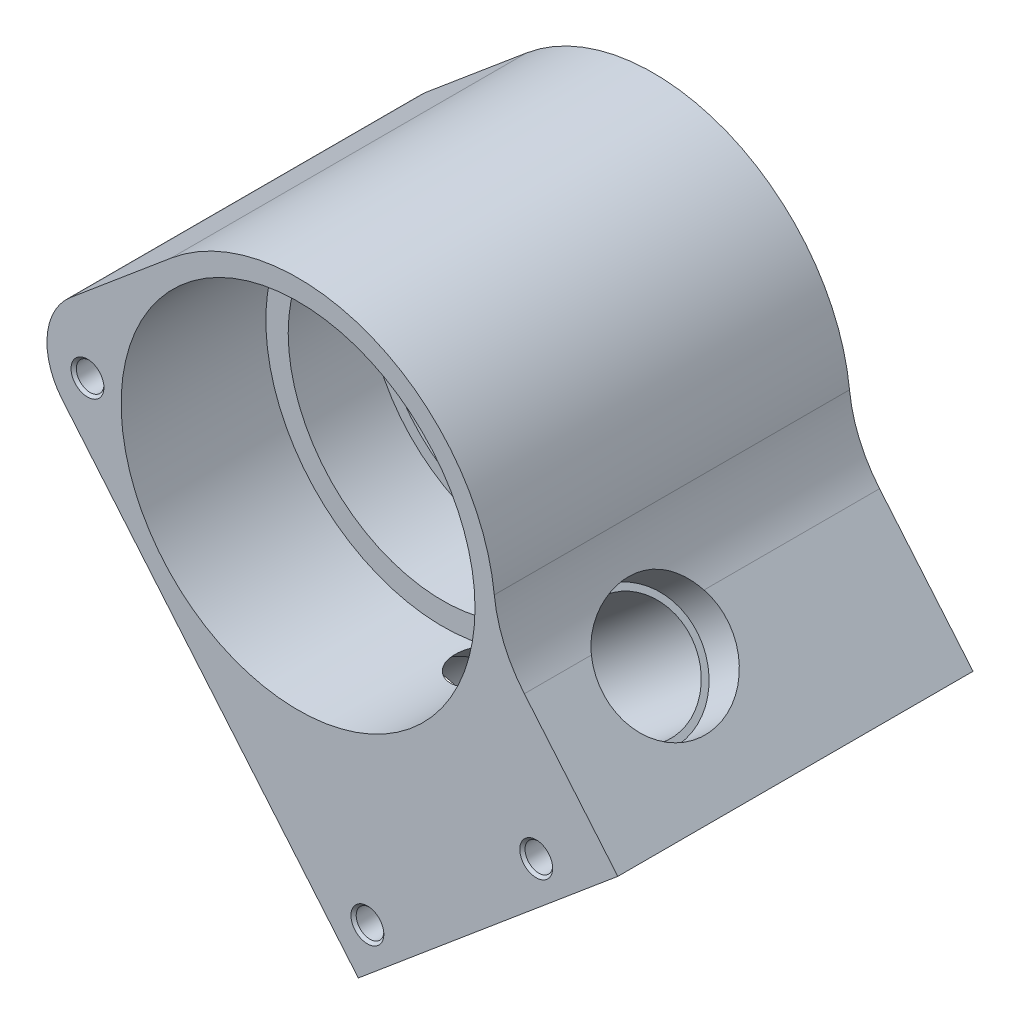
ISO-10303-21;
HEADER;
FILE_DESCRIPTION(('STEP AP214'),'2;1');
FILE_NAME('part.step','',(''),(''),'','','');
FILE_SCHEMA(('AUTOMOTIVE_DESIGN { 1 0 10303 214 1 1 1 1 }'));
ENDSEC;
DATA;
#1=APPLICATION_CONTEXT('core data for automotive mechanical design processes');
#2=APPLICATION_PROTOCOL_DEFINITION('international standard','automotive_design',2000,#1);
#3=PRODUCT_CONTEXT('',#1,'mechanical');
#4=PRODUCT('Part','Part','',(#3));
#5=PRODUCT_RELATED_PRODUCT_CATEGORY('part','',(#4));
#6=PRODUCT_DEFINITION_FORMATION('','',#4);
#7=PRODUCT_DEFINITION_CONTEXT('part definition',#1,'design');
#8=PRODUCT_DEFINITION('design','',#6,#7);
#9=PRODUCT_DEFINITION_SHAPE('','',#8);
#10=(LENGTH_UNIT() NAMED_UNIT(*) SI_UNIT(.MILLI.,.METRE.));
#11=(NAMED_UNIT(*) PLANE_ANGLE_UNIT() SI_UNIT($,.RADIAN.));
#12=(NAMED_UNIT(*) SI_UNIT($,.STERADIAN.) SOLID_ANGLE_UNIT());
#13=UNCERTAINTY_MEASURE_WITH_UNIT(LENGTH_MEASURE(1.E-05),#10,'distance_accuracy_value','');
#14=(GEOMETRIC_REPRESENTATION_CONTEXT(3) GLOBAL_UNCERTAINTY_ASSIGNED_CONTEXT((#13)) GLOBAL_UNIT_ASSIGNED_CONTEXT((#10,
#11,#12)) REPRESENTATION_CONTEXT('',''));
#15=CARTESIAN_POINT('',(0.,0.,0.));
#16=DIRECTION('',(0.,0.,1.));
#17=DIRECTION('',(1.,0.,0.));
#18=AXIS2_PLACEMENT_3D('',#15,#16,#17);
#19=CARTESIAN_POINT('',(-20.4141741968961,-58.9025592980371,35.25));
#20=DIRECTION('',(0.766044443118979,0.642787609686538,0.));
#21=DIRECTION('',(-0.642787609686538,0.766044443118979,0.));
#22=AXIS2_PLACEMENT_3D('',#19,#20,#21);
#23=CYLINDRICAL_SURFACE('',#22,8.5);
#24=CARTESIAN_POINT('',(7.16342575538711,-35.7622053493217,35.25));
#25=DIRECTION('',(-0.766044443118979,-0.642787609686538,0.));
#26=DIRECTION('',(0.642787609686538,-0.766044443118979,0.));
#27=AXIS2_PLACEMENT_3D('',#24,#25,#26);
#28=CIRCLE('',#27,8.5);
#29=CARTESIAN_POINT('',(12.6271204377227,-42.2735831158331,35.25));
#30=VERTEX_POINT('',#29);
#31=EDGE_CURVE('E238',#30,#30,#28,.F.);
#32=ORIENTED_EDGE('',*,*,#31,.F.);
#33=EDGE_LOOP('',(#32));
#34=FACE_BOUND('',#33,.T.);
#35=DIRECTION('',(0.766044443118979,0.642787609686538,0.));
#36=VECTOR('',#35,1.);
#37=CARTESIAN_POINT('',(-25.4627174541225,-52.8859397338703,32.));
#38=LINE('',#37,#36);
#39=CARTESIAN_POINT('',(6.43770523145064,-26.1183068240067,32.));
#40=VERTEX_POINT('',#39);
#41=CARTESIAN_POINT('',(24.6036152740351,-10.8752984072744,32.));
#42=VERTEX_POINT('',#41);
#43=EDGE_CURVE('E184',#40,#42,#38,.T.);
#44=ORIENTED_EDGE('',*,*,#43,.F.);
#45=CARTESIAN_POINT('',(6.43770523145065,-26.1183068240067,32.));
#46=CARTESIAN_POINT('',(6.35059455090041,-26.1397802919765,32.0955881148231));
#47=CARTESIAN_POINT('',(6.26625140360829,-26.1601045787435,32.1939037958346));
#48=CARTESIAN_POINT('',(6.10384674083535,-26.1984732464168,32.3961598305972));
#49=CARTESIAN_POINT('',(6.02579112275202,-26.2165154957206,32.5001053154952));
#50=CARTESIAN_POINT('',(5.80146083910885,-26.2674064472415,32.8217334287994));
#51=CARTESIAN_POINT('',(5.66616002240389,-26.296744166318,33.0479860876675));
#52=CARTESIAN_POINT('',(5.49100946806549,-26.3336749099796,33.4024540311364));
#53=CARTESIAN_POINT('',(5.43712933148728,-26.3448305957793,33.5235455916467));
#54=CARTESIAN_POINT('',(5.33977005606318,-26.3647362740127,33.7700147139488));
#55=CARTESIAN_POINT('',(5.29628581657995,-26.3734874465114,33.8953901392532));
#56=CARTESIAN_POINT('',(5.220683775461,-26.3885571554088,34.1492713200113));
#57=CARTESIAN_POINT('',(5.18853329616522,-26.3948826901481,34.2777669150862));
#58=CARTESIAN_POINT('',(5.13610688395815,-26.4051344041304,34.5372557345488));
#59=CARTESIAN_POINT('',(5.11582988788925,-26.4090607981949,34.6682487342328));
#60=CARTESIAN_POINT('',(5.08838974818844,-26.4143611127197,34.9243110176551));
#61=CARTESIAN_POINT('',(5.08056263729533,-26.4158643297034,35.0493066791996));
#62=CARTESIAN_POINT('',(5.07607187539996,-26.4167276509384,35.2995029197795));
#63=CARTESIAN_POINT('',(5.0794078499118,-26.4160878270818,35.4247034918));
#64=CARTESIAN_POINT('',(5.09718511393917,-26.4126633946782,35.6743795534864));
#65=CARTESIAN_POINT('',(5.1116345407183,-26.4098772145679,35.7988544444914));
#66=CARTESIAN_POINT('',(5.15132968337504,-26.4021627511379,36.0459671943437));
#67=CARTESIAN_POINT('',(5.17657525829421,-26.3972344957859,36.168605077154));
#68=CARTESIAN_POINT('',(5.2639590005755,-26.3799958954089,36.5170016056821));
#69=CARTESIAN_POINT('',(5.33907521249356,-26.3649950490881,36.7394923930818));
#70=CARTESIAN_POINT('',(5.52086434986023,-26.3275254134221,37.170180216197));
#71=CARTESIAN_POINT('',(5.62754012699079,-26.3050559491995,37.3783759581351));
#72=CARTESIAN_POINT('',(5.91664561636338,-26.2418205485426,37.860751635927));
#73=CARTESIAN_POINT('',(6.11215919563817,-26.1973309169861,38.12661212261));
#74=CARTESIAN_POINT('',(6.54083101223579,-26.0936036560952,38.6228237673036));
#75=CARTESIAN_POINT('',(6.77407194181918,-26.0343334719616,38.8530946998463));
#76=CARTESIAN_POINT('',(7.20255241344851,-25.9185116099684,39.2246387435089));
#77=CARTESIAN_POINT('',(7.39215985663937,-25.8651736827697,39.3735775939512));
#78=CARTESIAN_POINT('',(7.78167675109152,-25.7506638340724,39.6540950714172));
#79=CARTESIAN_POINT('',(7.9815912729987,-25.6894880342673,39.7856650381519));
#80=CARTESIAN_POINT('',(8.3888295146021,-25.5594077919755,40.0330318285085));
#81=CARTESIAN_POINT('',(8.59616244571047,-25.4904934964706,40.148808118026));
#82=CARTESIAN_POINT('',(9.01571597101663,-25.3451410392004,40.3659947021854));
#83=CARTESIAN_POINT('',(9.22793825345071,-25.2687002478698,40.4673999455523));
#84=CARTESIAN_POINT('',(9.6186119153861,-25.1222619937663,40.6409455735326));
#85=CARTESIAN_POINT('',(9.7965995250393,-25.0534146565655,40.7151204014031));
#86=CARTESIAN_POINT('',(10.1537997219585,-24.9107882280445,40.8553660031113));
#87=CARTESIAN_POINT('',(10.3330124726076,-24.8370084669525,40.9214356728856));
#88=CARTESIAN_POINT('',(10.8715688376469,-24.6083509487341,41.1086059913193));
#89=CARTESIAN_POINT('',(11.2317240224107,-24.4461946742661,41.2186218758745));
#90=CARTESIAN_POINT('',(11.9504446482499,-24.1030283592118,41.4140316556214));
#91=CARTESIAN_POINT('',(12.3090056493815,-23.9219823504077,41.4993773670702));
#92=CARTESIAN_POINT('',(13.0209587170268,-23.5420346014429,41.6489703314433));
#93=CARTESIAN_POINT('',(13.3743513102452,-23.3431346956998,41.7132197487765));
#94=CARTESIAN_POINT('',(13.9745611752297,-22.9870954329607,41.8078371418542));
#95=CARTESIAN_POINT('',(14.2231744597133,-22.8341144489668,41.8426462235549));
#96=CARTESIAN_POINT('',(14.716050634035,-22.5196202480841,41.9036998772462));
#97=CARTESIAN_POINT('',(14.9603131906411,-22.3581063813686,41.9299437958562));
#98=CARTESIAN_POINT('',(15.4439959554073,-22.0267782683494,41.9744768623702));
#99=CARTESIAN_POINT('',(15.6834145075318,-21.8569612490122,41.992763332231));
#100=CARTESIAN_POINT('',(16.1568851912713,-21.5093311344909,42.0217923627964));
#101=CARTESIAN_POINT('',(16.3909366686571,-21.3315170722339,42.03253400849));
#102=CARTESIAN_POINT('',(16.8533296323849,-20.9681136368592,42.0467218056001));
#103=CARTESIAN_POINT('',(17.0816683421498,-20.7825205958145,42.0501644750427));
#104=CARTESIAN_POINT('',(17.5321037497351,-20.4039672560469,42.0498235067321));
#105=CARTESIAN_POINT('',(17.7542011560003,-20.2110077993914,42.0460406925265));
#106=CARTESIAN_POINT('',(18.1917550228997,-19.8180845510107,42.0311656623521));
#107=CARTESIAN_POINT('',(18.4072133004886,-19.6181227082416,42.0200754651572));
#108=CARTESIAN_POINT('',(18.8311752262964,-19.2115363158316,41.9903286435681));
#109=CARTESIAN_POINT('',(19.0396791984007,-19.004912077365,41.9716723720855));
#110=CARTESIAN_POINT('',(19.5654234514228,-18.4665905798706,41.9135509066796));
#111=CARTESIAN_POINT('',(19.8773910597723,-18.1303140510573,41.8682845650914));
#112=CARTESIAN_POINT('',(20.4820562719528,-17.4443259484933,41.7556256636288));
#113=CARTESIAN_POINT('',(20.7747513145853,-17.0946125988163,41.6882301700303));
#114=CARTESIAN_POINT('',(21.3386231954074,-16.3852871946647,41.5277031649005));
#115=CARTESIAN_POINT('',(21.6098554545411,-16.025704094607,41.4346409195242));
#116=CARTESIAN_POINT('',(21.9997267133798,-15.4813418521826,41.2718354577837));
#117=CARTESIAN_POINT('',(22.1268349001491,-15.2990866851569,41.2137096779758));
#118=CARTESIAN_POINT('',(22.3751787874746,-14.9335244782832,41.0888966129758));
#119=CARTESIAN_POINT('',(22.4964153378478,-14.7502175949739,41.0222105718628));
#120=CARTESIAN_POINT('',(22.7417271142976,-14.369376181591,40.8739482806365));
#121=CARTESIAN_POINT('',(22.8653184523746,-14.1718185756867,40.7916257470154));
#122=CARTESIAN_POINT('',(23.1049715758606,-13.7776435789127,40.6147765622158));
#123=CARTESIAN_POINT('',(23.2210352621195,-13.5810259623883,40.5202530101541));
#124=CARTESIAN_POINT('',(23.4451863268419,-13.1902975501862,40.3176036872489));
#125=CARTESIAN_POINT('',(23.5532754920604,-12.9961862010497,40.2094809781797));
#126=CARTESIAN_POINT('',(23.7609600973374,-12.6124668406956,39.9781120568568));
#127=CARTESIAN_POINT('',(23.860557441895,-12.4228578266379,39.8548692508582));
#128=CARTESIAN_POINT('',(24.0291485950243,-12.0928160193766,39.6214563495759));
#129=CARTESIAN_POINT('',(24.0999712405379,-11.9509552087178,39.5146281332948));
#130=CARTESIAN_POINT('',(24.2358402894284,-11.6729590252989,39.2902562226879));
#131=CARTESIAN_POINT('',(24.30088553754,-11.5368248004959,39.1727103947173));
#132=CARTESIAN_POINT('',(24.4246966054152,-11.2723322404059,38.9265012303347));
#133=CARTESIAN_POINT('',(24.4834724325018,-11.1439616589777,38.7978562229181));
#134=CARTESIAN_POINT('',(24.5944064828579,-10.8969503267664,38.5289530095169));
#135=CARTESIAN_POINT('',(24.6465655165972,-10.7783083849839,38.3886962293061));
#136=CARTESIAN_POINT('',(24.7659068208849,-10.501978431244,38.0298143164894));
#137=CARTESIAN_POINT('',(24.8291709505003,-10.3509917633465,37.8045007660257));
#138=CARTESIAN_POINT('',(24.9115220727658,-10.1504362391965,37.449210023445));
#139=CARTESIAN_POINT('',(24.9368871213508,-10.0878908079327,37.327855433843));
#140=CARTESIAN_POINT('',(24.9832483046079,-9.97251993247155,37.0798225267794));
#141=CARTESIAN_POINT('',(25.0042463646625,-9.9196902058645,36.9531465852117));
#142=CARTESIAN_POINT('',(25.0418649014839,-9.82434047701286,36.6938720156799));
#143=CARTESIAN_POINT('',(25.0584398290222,-9.78192808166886,36.5612270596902));
#144=CARTESIAN_POINT('',(25.0867513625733,-9.70909037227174,36.2922382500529));
#145=CARTESIAN_POINT('',(25.0984904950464,-9.67865879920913,36.1558963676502));
#146=CARTESIAN_POINT('',(25.1169993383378,-9.63052504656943,35.8807031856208));
#147=CARTESIAN_POINT('',(25.123771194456,-9.6128173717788,35.7418529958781));
#148=CARTESIAN_POINT('',(25.1322676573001,-9.59058229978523,35.4629547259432));
#149=CARTESIAN_POINT('',(25.1339929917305,-9.58605300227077,35.322906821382));
#150=CARTESIAN_POINT('',(25.1324902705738,-9.58999099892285,35.0625853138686));
#151=CARTESIAN_POINT('',(25.1299195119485,-9.59673373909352,34.9422780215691));
#152=CARTESIAN_POINT('',(25.1210512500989,-9.6199240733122,34.7027028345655));
#153=CARTESIAN_POINT('',(25.1147525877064,-9.63637468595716,34.5834352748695));
#154=CARTESIAN_POINT('',(25.0984872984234,-9.67865935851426,34.3468813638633));
#155=CARTESIAN_POINT('',(25.0885221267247,-9.70448969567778,34.2295942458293));
#156=CARTESIAN_POINT('',(25.0650121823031,-9.76505052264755,33.9976910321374));
#157=CARTESIAN_POINT('',(25.051466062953,-9.79978436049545,33.8830759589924));
#158=CARTESIAN_POINT('',(25.0058463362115,-9.91587464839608,33.5460115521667));
#159=CARTESIAN_POINT('',(24.9686534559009,-10.0094880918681,33.3283672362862));
#160=CARTESIAN_POINT('',(24.8815854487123,-10.2239911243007,32.9098783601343));
#161=CARTESIAN_POINT('',(24.8317061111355,-10.3448897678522,32.7090394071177));
#162=CARTESIAN_POINT('',(24.7497838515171,-10.5386323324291,32.4269771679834));
#163=CARTESIAN_POINT('',(24.7222197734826,-10.6031653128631,32.3385633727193));
#164=CARTESIAN_POINT('',(24.6646991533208,-10.7362873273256,32.1660980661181));
#165=CARTESIAN_POINT('',(24.6347499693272,-10.8048637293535,32.0820343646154));
#166=CARTESIAN_POINT('',(24.6036152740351,-10.8752984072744,32.));
#167=B_SPLINE_CURVE_WITH_KNOTS('',3,(#45,#46,#47,#48,#49,#50,#51,#52,#53,#54,#55,#56,#57,#58,
#59,#60,#61,#62,#63,#64,#65,#66,#67,#68,#69,#70,#71,#72,#73,#74,#75,#76,#77,#78,#79,#80,#81,#82,
#83,#84,#85,#86,#87,#88,#89,#90,#91,#92,#93,#94,#95,#96,#97,#98,#99,#100,#101,#102,#103,#104,
#105,#106,#107,#108,#109,#110,#111,#112,#113,#114,#115,#116,#117,#118,#119,#120,#121,#122,#123,
#124,#125,#126,#127,#128,#129,#130,#131,#132,#133,#134,#135,#136,#137,#138,#139,#140,#141,#142,
#143,#144,#145,#146,#147,#148,#149,#150,#151,#152,#153,#154,#155,#156,#157,#158,#159,#160,#161,
#162,#163,#164,#165,#166),.UNSPECIFIED.,.F.,.F.,(4,2,2,2,2,2,2,2,2,2,2,2,2,2,2,2,2,2,2,2,2,2,2,
2,2,2,2,2,2,2,2,2,2,2,2,2,2,2,2,2,2,2,2,2,2,2,2,2,2,2,2,2,2,2,2,2,2,2,2,2,4),(0.,
0.393128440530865,0.786621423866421,1.57864177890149,1.977266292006,2.37569482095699,
2.77296501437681,3.17019963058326,3.54543866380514,3.92066510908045,4.2961665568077,
4.67166310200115,5.37437986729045,6.07716014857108,7.07058068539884,8.06620890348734,
8.80604427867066,9.54624716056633,10.2874034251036,11.0288195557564,11.642825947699,
12.2569158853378,13.4854624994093,14.7163926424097,15.9471964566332,16.8288689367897,
17.7106086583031,18.592644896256,19.4747880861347,20.3573520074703,21.2398153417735,
22.1220349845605,23.0042134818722,24.3858569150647,25.7676835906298,27.1458170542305,
27.8346587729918,28.5234004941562,29.2644585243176,30.0053286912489,30.7460323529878,
31.4865694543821,32.0597180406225,32.6329809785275,33.2053147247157,33.7775782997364,
34.6094349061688,35.0256040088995,35.4415892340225,35.8617060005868,36.2816029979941,
36.7013185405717,37.1209735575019,37.4820984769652,37.8433357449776,38.2044297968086,
38.5656598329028,39.2821474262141,39.9988731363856,40.3373547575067,40.6748298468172),.UNSPECIFIED.);
#168=EDGE_CURVE('E191',#40,#42,#167,.T.);
#169=ORIENTED_EDGE('',*,*,#168,.T.);
#170=EDGE_LOOP('',(#44,#169));
#171=FACE_BOUND('',#170,.T.);
#172=CARTESIAN_POINT('',(32.4428923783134,-14.550214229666,35.25));
#173=DIRECTION('',(0.766044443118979,0.642787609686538,0.));
#174=DIRECTION('',(-0.642787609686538,0.766044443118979,0.));
#175=AXIS2_PLACEMENT_3D('',#172,#173,#174);
#176=CIRCLE('',#175,8.5);
#177=CARTESIAN_POINT('',(26.9791976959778,-8.03883646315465,35.25));
#178=VERTEX_POINT('',#177);
#179=EDGE_CURVE('E50',#178,#178,#176,.F.);
#180=ORIENTED_EDGE('',*,*,#179,.F.);
#181=EDGE_LOOP('',(#180));
#182=FACE_BOUND('',#181,.T.);
#183=ADVANCED_FACE('F45',(#34,#171,#182),#23,.F.);
#184=CARTESIAN_POINT('',(0.,0.,54.));
#185=DIRECTION('',(0.,0.,-1.));
#186=DIRECTION('',(-1.,0.,0.));
#187=AXIS2_PLACEMENT_3D('',#184,#185,#186);
#188=CYLINDRICAL_SURFACE('',#187,21.7499999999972);
#189=CARTESIAN_POINT('',(0.,0.,12.));
#190=DIRECTION('',(0.,0.,-1.));
#191=DIRECTION('',(-1.,0.,0.));
#192=AXIS2_PLACEMENT_3D('',#189,#190,#191);
#193=CIRCLE('',#192,21.7499999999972);
#194=CARTESIAN_POINT('',(-21.7499999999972,0.,12.));
#195=VERTEX_POINT('',#194);
#196=EDGE_CURVE('E185',#195,#195,#193,.T.);
#197=ORIENTED_EDGE('',*,*,#196,.T.);
#198=EDGE_LOOP('',(#197));
#199=FACE_BOUND('',#198,.T.);
#200=CARTESIAN_POINT('',(0.,0.,20.));
#201=DIRECTION('',(0.,0.,1.));
#202=DIRECTION('',(1.,0.,0.));
#203=AXIS2_PLACEMENT_3D('',#200,#201,#202);
#204=CIRCLE('',#203,21.7499999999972);
#205=CARTESIAN_POINT('',(21.7499999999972,0.,20.));
#206=VERTEX_POINT('',#205);
#207=EDGE_CURVE('E201',#206,#206,#204,.T.);
#208=ORIENTED_EDGE('',*,*,#207,.T.);
#209=EDGE_LOOP('',(#208));
#210=FACE_BOUND('',#209,.T.);
#211=ADVANCED_FACE('F228',(#199,#210),#188,.F.);
#212=CARTESIAN_POINT('',(49.7170142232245,5.31210850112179,54.));
#213=DIRECTION('',(0.,0.,-1.));
#214=DIRECTION('',(-1.,0.,0.));
#215=AXIS2_PLACEMENT_3D('',#212,#213,#214);
#216=PLANE('',#215);
#217=CARTESIAN_POINT('',(36.2028646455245,-28.3655176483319,54.));
#218=DIRECTION('',(0.,0.,1.));
#219=DIRECTION('',(1.,0.,0.));
#220=AXIS2_PLACEMENT_3D('',#217,#218,#219);
#221=CIRCLE('',#220,2.5);
#222=CARTESIAN_POINT('',(38.7028646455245,-28.3655176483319,54.));
#223=VERTEX_POINT('',#222);
#224=EDGE_CURVE('E342',#223,#223,#221,.T.);
#225=ORIENTED_EDGE('',*,*,#224,.F.);
#226=EDGE_LOOP('',(#225));
#227=FACE_BOUND('',#226,.T.);
#228=CARTESIAN_POINT('',(-32.0121639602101,0.813239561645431,54.));
#229=DIRECTION('',(0.,0.,1.));
#230=DIRECTION('',(1.,0.,0.));
#231=AXIS2_PLACEMENT_3D('',#228,#229,#230);
#232=CIRCLE('',#231,2.5);
#233=CARTESIAN_POINT('',(-29.5121639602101,0.813239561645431,54.));
#234=VERTEX_POINT('',#233);
#235=EDGE_CURVE('E351',#234,#234,#232,.T.);
#236=ORIENTED_EDGE('',*,*,#235,.F.);
#237=EDGE_LOOP('',(#236));
#238=FACE_BOUND('',#237,.T.);
#239=CARTESIAN_POINT('',(10.5403758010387,-49.898902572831,54.));
#240=DIRECTION('',(0.,0.,1.));
#241=DIRECTION('',(1.,0.,0.));
#242=AXIS2_PLACEMENT_3D('',#239,#240,#241);
#243=CIRCLE('',#242,2.5);
#244=CARTESIAN_POINT('',(13.0403758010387,-49.898902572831,54.));
#245=VERTEX_POINT('',#244);
#246=EDGE_CURVE('E360',#245,#245,#243,.T.);
#247=ORIENTED_EDGE('',*,*,#246,.F.);
#248=EDGE_LOOP('',(#247));
#249=FACE_BOUND('',#248,.T.);
#250=CARTESIAN_POINT('',(0.,0.,54.));
#251=DIRECTION('',(0.,0.,1.));
#252=DIRECTION('',(1.,0.,0.));
#253=AXIS2_PLACEMENT_3D('',#250,#251,#252);
#254=CIRCLE('',#253,26.9);
#255=CARTESIAN_POINT('',(26.9,0.,54.));
#256=VERTEX_POINT('',#255);
#257=EDGE_CURVE('E369',#256,#256,#254,.T.);
#258=ORIENTED_EDGE('',*,*,#257,.F.);
#259=EDGE_LOOP('',(#258));
#260=FACE_BOUND('',#259,.T.);
#261=DIRECTION('',(-0.766044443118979,-0.642787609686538,0.));
#262=VECTOR('',#261,1.);
#263=CARTESIAN_POINT('',(-19.2836282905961,22.9813332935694,54.));
#264=LINE('',#263,#262);
#265=CARTESIAN_POINT('',(-19.2836282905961,22.9813332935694,54.));
#266=VERTEX_POINT('',#265);
#267=CARTESIAN_POINT('',(-34.6045171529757,10.1255810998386,54.));
#268=VERTEX_POINT('',#267);
#269=EDGE_CURVE('E395',#266,#268,#264,.T.);
#270=ORIENTED_EDGE('',*,*,#269,.T.);
#271=CARTESIAN_POINT('',(-28.1766410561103,2.46513666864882,54.));
#272=DIRECTION('',(0.,0.,-1.));
#273=DIRECTION('',(-1.,0.,0.));
#274=AXIS2_PLACEMENT_3D('',#271,#272,#273);
#275=CIRCLE('',#274,10.);
#276=CARTESIAN_POINT('',(-35.8370854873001,-3.96273942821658,54.));
#277=VERTEX_POINT('',#276);
#278=EDGE_CURVE('E55',#268,#277,#275,.F.);
#279=ORIENTED_EDGE('',*,*,#278,.T.);
#280=DIRECTION('',(0.642787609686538,-0.766044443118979,0.));
#281=VECTOR('',#280,1.);
#282=CARTESIAN_POINT('',(9.15804719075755,-57.5858504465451,54.));
#283=LINE('',#282,#281);
#284=CARTESIAN_POINT('',(9.15804719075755,-57.5858504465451,54.));
#285=VERTEX_POINT('',#284);
#286=EDGE_CURVE('E397',#277,#285,#283,.T.);
#287=ORIENTED_EDGE('',*,*,#286,.T.);
#288=DIRECTION('',(0.766044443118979,0.642787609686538,0.));
#289=VECTOR('',#288,1.);
#290=CARTESIAN_POINT('',(48.609336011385,-24.4822885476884,54.));
#291=LINE('',#290,#289);
#292=CARTESIAN_POINT('',(48.609336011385,-24.4822885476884,54.));
#293=VERTEX_POINT('',#292);
#294=EDGE_CURVE('E170',#285,#293,#291,.T.);
#295=ORIENTED_EDGE('',*,*,#294,.T.);
#296=DIRECTION('',(-0.642787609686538,0.766044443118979,0.));
#297=VECTOR('',#296,1.);
#298=CARTESIAN_POINT('',(34.3961253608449,-7.54364369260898,54.));
#299=LINE('',#298,#297);
#300=CARTESIAN_POINT('',(34.3961253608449,-7.54364369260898,54.));
#301=VERTEX_POINT('',#300);
#302=EDGE_CURVE('E167',#293,#301,#299,.T.);
#303=ORIENTED_EDGE('',*,*,#302,.T.);
#304=CARTESIAN_POINT('',(49.7170142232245,5.31210850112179,54.));
#305=DIRECTION('',(0.,0.,-1.));
#306=DIRECTION('',(-1.,0.,0.));
#307=AXIS2_PLACEMENT_3D('',#304,#305,#306);
#308=CIRCLE('',#307,20.);
#309=CARTESIAN_POINT('',(29.8302085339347,3.18726510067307,54.));
#310=VERTEX_POINT('',#309);
#311=EDGE_CURVE('E390',#301,#310,#308,.T.);
#312=ORIENTED_EDGE('',*,*,#311,.T.);
#313=CARTESIAN_POINT('',(0.,0.,54.));
#314=DIRECTION('',(0.,0.,1.));
#315=DIRECTION('',(1.,0.,0.));
#316=AXIS2_PLACEMENT_3D('',#313,#314,#315);
#317=CIRCLE('',#316,30.);
#318=EDGE_CURVE('E393',#310,#266,#317,.T.);
#319=ORIENTED_EDGE('',*,*,#318,.T.);
#320=EDGE_LOOP('',(#270,#279,#287,#295,#303,#312,#319));
#321=FACE_BOUND('',#320,.T.);
#322=ADVANCED_FACE('F233',(#227,#238,#249,#260,#321),#216,.F.);
#323=CARTESIAN_POINT('',(49.7170142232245,5.31210850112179,0.));
#324=DIRECTION('',(0.,0.,-1.));
#325=DIRECTION('',(-1.,0.,0.));
#326=AXIS2_PLACEMENT_3D('',#323,#324,#325);
#327=PLANE('',#326);
#328=CARTESIAN_POINT('',(0.,0.,0.));
#329=DIRECTION('',(0.,0.,-1.));
#330=DIRECTION('',(-1.,0.,0.));
#331=AXIS2_PLACEMENT_3D('',#328,#329,#330);
#332=CIRCLE('',#331,23.5);
#333=CARTESIAN_POINT('',(-23.5,0.,0.));
#334=VERTEX_POINT('',#333);
#335=EDGE_CURVE('E374',#334,#334,#332,.T.);
#336=ORIENTED_EDGE('',*,*,#335,.F.);
#337=EDGE_LOOP('',(#336));
#338=FACE_BOUND('',#337,.T.);
#339=DIRECTION('',(0.642787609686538,-0.766044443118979,0.));
#340=VECTOR('',#339,1.);
#341=CARTESIAN_POINT('',(9.15804719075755,-57.5858504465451,0.));
#342=LINE('',#341,#340);
#343=CARTESIAN_POINT('',(-35.8370854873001,-3.96273942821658,0.));
#344=VERTEX_POINT('',#343);
#345=CARTESIAN_POINT('',(9.15804719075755,-57.5858504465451,0.));
#346=VERTEX_POINT('',#345);
#347=EDGE_CURVE('E385',#344,#346,#342,.T.);
#348=ORIENTED_EDGE('',*,*,#347,.F.);
#349=CARTESIAN_POINT('',(-28.1766410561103,2.46513666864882,0.));
#350=DIRECTION('',(0.,0.,-1.));
#351=DIRECTION('',(-1.,0.,0.));
#352=AXIS2_PLACEMENT_3D('',#349,#350,#351);
#353=CIRCLE('',#352,10.);
#354=CARTESIAN_POINT('',(-34.6045171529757,10.1255810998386,0.));
#355=VERTEX_POINT('',#354);
#356=EDGE_CURVE('E438',#344,#355,#353,.T.);
#357=ORIENTED_EDGE('',*,*,#356,.T.);
#358=DIRECTION('',(-0.766044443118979,-0.642787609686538,0.));
#359=VECTOR('',#358,1.);
#360=CARTESIAN_POINT('',(-19.2836282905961,22.9813332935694,0.));
#361=LINE('',#360,#359);
#362=CARTESIAN_POINT('',(-19.2836282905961,22.9813332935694,0.));
#363=VERTEX_POINT('',#362);
#364=EDGE_CURVE('E383',#363,#355,#361,.T.);
#365=ORIENTED_EDGE('',*,*,#364,.F.);
#366=CARTESIAN_POINT('',(0.,0.,0.));
#367=DIRECTION('',(0.,0.,1.));
#368=DIRECTION('',(1.,0.,0.));
#369=AXIS2_PLACEMENT_3D('',#366,#367,#368);
#370=CIRCLE('',#369,30.);
#371=CARTESIAN_POINT('',(29.8302085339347,3.18726510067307,0.));
#372=VERTEX_POINT('',#371);
#373=EDGE_CURVE('E380',#372,#363,#370,.T.);
#374=ORIENTED_EDGE('',*,*,#373,.F.);
#375=CARTESIAN_POINT('',(49.7170142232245,5.31210850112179,0.));
#376=DIRECTION('',(0.,0.,-1.));
#377=DIRECTION('',(-1.,0.,0.));
#378=AXIS2_PLACEMENT_3D('',#375,#376,#377);
#379=CIRCLE('',#378,20.);
#380=CARTESIAN_POINT('',(34.3961253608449,-7.54364369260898,0.));
#381=VERTEX_POINT('',#380);
#382=EDGE_CURVE('E188',#381,#372,#379,.T.);
#383=ORIENTED_EDGE('',*,*,#382,.F.);
#384=DIRECTION('',(-0.642787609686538,0.766044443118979,0.));
#385=VECTOR('',#384,1.);
#386=CARTESIAN_POINT('',(34.3961253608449,-7.54364369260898,0.));
#387=LINE('',#386,#385);
#388=CARTESIAN_POINT('',(48.609336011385,-24.4822885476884,0.));
#389=VERTEX_POINT('',#388);
#390=EDGE_CURVE('E165',#389,#381,#387,.T.);
#391=ORIENTED_EDGE('',*,*,#390,.F.);
#392=DIRECTION('',(0.766044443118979,0.642787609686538,0.));
#393=VECTOR('',#392,1.);
#394=CARTESIAN_POINT('',(48.609336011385,-24.4822885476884,0.));
#395=LINE('',#394,#393);
#396=EDGE_CURVE('E387',#346,#389,#395,.T.);
#397=ORIENTED_EDGE('',*,*,#396,.F.);
#398=EDGE_LOOP('',(#348,#357,#365,#374,#383,#391,#397));
#399=FACE_BOUND('',#398,.T.);
#400=ADVANCED_FACE('F428',(#338,#399),#327,.T.);
#401=CARTESIAN_POINT('',(49.7170142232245,5.31210850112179,54.));
#402=DIRECTION('',(0.,0.,-1.));
#403=DIRECTION('',(-1.,0.,0.));
#404=AXIS2_PLACEMENT_3D('',#401,#402,#403);
#405=CYLINDRICAL_SURFACE('',#404,20.);
#406=DIRECTION('',(0.,0.,-1.));
#407=VECTOR('',#406,1.);
#408=CARTESIAN_POINT('',(34.3961253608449,-7.54364369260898,54.));
#409=LINE('',#408,#407);
#410=CARTESIAN_POINT('',(34.3961253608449,-7.54364369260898,43.8140440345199));
#411=VERTEX_POINT('',#410);
#412=EDGE_CURVE('E159',#301,#411,#409,.T.);
#413=ORIENTED_EDGE('',*,*,#412,.T.);
#414=CARTESIAN_POINT('',(31.4991513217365,-2.94073775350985,35.25));
#415=CARTESIAN_POINT('',(31.4991514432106,-2.94073650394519,34.9873893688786));
#416=CARTESIAN_POINT('',(31.5038127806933,-2.9510506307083,34.7247927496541));
#417=CARTESIAN_POINT('',(31.5225108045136,-2.99214093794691,34.2014505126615));
#418=CARTESIAN_POINT('',(31.5365505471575,-3.02292378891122,33.9407055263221));
#419=CARTESIAN_POINT('',(31.5741800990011,-3.10451694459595,33.4227084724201));
#420=CARTESIAN_POINT('',(31.5977828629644,-3.1553544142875,33.1654616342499));
#421=CARTESIAN_POINT('',(31.6547749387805,-3.27625403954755,32.6566587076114));
#422=CARTESIAN_POINT('',(31.6881635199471,-3.3463147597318,32.4051021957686));
#423=CARTESIAN_POINT('',(31.7649626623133,-3.50444097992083,31.909917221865));
#424=CARTESIAN_POINT('',(31.8083509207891,-3.59246636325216,31.6662724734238));
#425=CARTESIAN_POINT('',(31.9055917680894,-3.78541299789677,31.1878285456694));
#426=CARTESIAN_POINT('',(31.9594480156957,-3.89034015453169,30.9530324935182));
#427=CARTESIAN_POINT('',(32.0780359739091,-4.11565058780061,30.4939086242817));
#428=CARTESIAN_POINT('',(32.1427651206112,-4.23603021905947,30.2695783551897));
#429=CARTESIAN_POINT('',(32.2835688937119,-4.49075612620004,29.8327172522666));
#430=CARTESIAN_POINT('',(32.3596436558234,-4.62510256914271,29.6201865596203));
#431=CARTESIAN_POINT('',(32.5256108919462,-4.90960494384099,29.2031987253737));
#432=CARTESIAN_POINT('',(32.6157964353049,-5.06006774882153,28.9990673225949));
#433=CARTESIAN_POINT('',(32.808980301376,-5.37208716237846,28.606036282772));
#434=CARTESIAN_POINT('',(32.9119739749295,-5.533639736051,28.417131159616));
#435=CARTESIAN_POINT('',(33.1311877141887,-5.86599436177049,28.055781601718));
#436=CARTESIAN_POINT('',(33.2474096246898,-6.03679770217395,27.8833394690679));
#437=CARTESIAN_POINT('',(33.4933031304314,-6.38561431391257,27.5562452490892));
#438=CARTESIAN_POINT('',(33.6229743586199,-6.56362738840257,27.4015926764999));
#439=CARTESIAN_POINT('',(33.8938370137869,-6.92213829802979,27.1134066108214));
#440=CARTESIAN_POINT('',(34.0348342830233,-7.10256275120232,26.9795995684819));
#441=CARTESIAN_POINT('',(34.3297556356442,-7.4662746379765,26.7315257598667));
#442=CARTESIAN_POINT('',(34.4836796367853,-7.64956205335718,26.6172588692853));
#443=CARTESIAN_POINT('',(34.8039278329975,-8.01677632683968,26.4092344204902));
#444=CARTESIAN_POINT('',(34.9702462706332,-8.20070285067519,26.3154674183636));
#445=CARTESIAN_POINT('',(35.314600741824,-8.56714508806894,26.1490893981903));
#446=CARTESIAN_POINT('',(35.4926361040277,-8.74966088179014,26.0764771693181));
#447=CARTESIAN_POINT('',(35.8479401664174,-9.09993817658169,25.9567102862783));
#448=CARTESIAN_POINT('',(36.0245633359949,-9.26790961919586,25.908249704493));
#449=CARTESIAN_POINT('',(36.3861442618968,-9.59923025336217,25.8304434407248));
#450=CARTESIAN_POINT('',(36.5711016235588,-9.76257966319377,25.801096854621));
#451=CARTESIAN_POINT('',(36.9481279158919,-10.0832410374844,25.7614140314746));
#452=CARTESIAN_POINT('',(37.1401965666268,-10.2405532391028,25.7510770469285));
#453=CARTESIAN_POINT('',(37.5301227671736,-10.5479455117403,25.7490827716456));
#454=CARTESIAN_POINT('',(37.7279804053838,-10.6980254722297,25.7574257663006));
#455=CARTESIAN_POINT('',(38.1263838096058,-10.9887376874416,25.7921224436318));
#456=CARTESIAN_POINT('',(38.326892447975,-11.1294393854,25.8183224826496));
#457=CARTESIAN_POINT('',(38.7308494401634,-11.4020640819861,25.8879199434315));
#458=CARTESIAN_POINT('',(38.9342977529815,-11.5339872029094,25.9313171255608));
#459=CARTESIAN_POINT('',(39.3427837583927,-11.7885717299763,26.0345585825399));
#460=CARTESIAN_POINT('',(39.5478214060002,-11.911233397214,26.0944023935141));
#461=CARTESIAN_POINT('',(39.9582640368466,-12.1470680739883,26.2297632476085));
#462=CARTESIAN_POINT('',(40.163669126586,-12.2602376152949,26.3052859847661));
#463=CARTESIAN_POINT('',(40.5923374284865,-12.4868889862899,26.4788015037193));
#464=CARTESIAN_POINT('',(40.8155116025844,-12.5994484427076,26.5782194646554));
#465=CARTESIAN_POINT('',(41.2592970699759,-12.8132252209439,26.7938108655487));
#466=CARTESIAN_POINT('',(41.4799072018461,-12.9144375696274,26.9099916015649));
#467=CARTESIAN_POINT('',(41.9171389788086,-13.1057883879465,27.1582419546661));
#468=CARTESIAN_POINT('',(42.1337581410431,-13.1959201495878,27.2903211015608));
#469=CARTESIAN_POINT('',(42.5614442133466,-13.3654380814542,27.5695197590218));
#470=CARTESIAN_POINT('',(42.7725106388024,-13.4448233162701,27.7166405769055));
#471=CARTESIAN_POINT('',(43.2165508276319,-13.6036792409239,28.0467480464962));
#472=CARTESIAN_POINT('',(43.4484832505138,-13.6816229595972,28.2318763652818));
#473=CARTESIAN_POINT('',(43.9010197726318,-13.8250431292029,28.6200075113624));
#474=CARTESIAN_POINT('',(44.1216219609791,-13.8905174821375,28.823013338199));
#475=CARTESIAN_POINT('',(44.5489846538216,-14.0099167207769,29.2462959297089));
#476=CARTESIAN_POINT('',(44.7557462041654,-14.0638424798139,29.4665713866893));
#477=CARTESIAN_POINT('',(45.1524689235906,-14.1611217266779,29.9237419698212));
#478=CARTESIAN_POINT('',(45.3424344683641,-14.204477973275,30.160632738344));
#479=CARTESIAN_POINT('',(45.8064801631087,-14.3040020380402,30.7925080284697));
#480=CARTESIAN_POINT('',(46.0658494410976,-14.3531275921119,31.1998448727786));
#481=CARTESIAN_POINT('',(46.4052436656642,-14.4121272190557,31.8378185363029));
#482=CARTESIAN_POINT('',(46.5100648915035,-14.4293414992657,32.0548744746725));
#483=CARTESIAN_POINT('',(46.7011054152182,-14.4594271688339,32.4973872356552));
#484=CARTESIAN_POINT('',(46.7873280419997,-14.4722993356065,32.7228425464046));
#485=CARTESIAN_POINT('',(46.9266397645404,-14.4923843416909,33.1437157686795));
#486=CARTESIAN_POINT('',(46.982833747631,-14.5001761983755,33.3380822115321));
#487=CARTESIAN_POINT('',(47.0794016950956,-14.5132636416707,33.7307787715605));
#488=CARTESIAN_POINT('',(47.1197788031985,-14.5185597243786,33.9291080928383));
#489=CARTESIAN_POINT('',(47.1837453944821,-14.5268328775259,34.3283887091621));
#490=CARTESIAN_POINT('',(47.2073453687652,-14.5298113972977,34.529338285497));
#491=CARTESIAN_POINT('',(47.2371968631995,-14.5335644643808,34.9325539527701));
#492=CARTESIAN_POINT('',(47.2434481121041,-14.5343389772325,35.1348200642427));
#493=CARTESIAN_POINT('',(47.2384326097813,-14.5337132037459,35.5393036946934));
#494=CARTESIAN_POINT('',(47.2271508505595,-14.5323110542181,35.7415210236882));
#495=CARTESIAN_POINT('',(47.1873404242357,-14.5272752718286,36.144208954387));
#496=CARTESIAN_POINT('',(47.1588119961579,-14.5236416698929,36.3446795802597));
#497=CARTESIAN_POINT('',(47.0851982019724,-14.514008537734,36.7426348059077));
#498=CARTESIAN_POINT('',(47.0401008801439,-14.5080072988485,36.9401171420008));
#499=CARTESIAN_POINT('',(46.9343867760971,-14.4934418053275,37.3307984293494));
#500=CARTESIAN_POINT('',(46.8737668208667,-14.4848770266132,37.523996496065));
#501=CARTESIAN_POINT('',(46.7219809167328,-14.4625466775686,37.9508731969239));
#502=CARTESIAN_POINT('',(46.6269759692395,-14.4480264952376,38.1831507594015));
#503=CARTESIAN_POINT('',(46.4175128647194,-14.4141311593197,38.6383805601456));
#504=CARTESIAN_POINT('',(46.3030503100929,-14.3947549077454,38.8613306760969));
#505=CARTESIAN_POINT('',(46.0569523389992,-14.3505360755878,39.2974037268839));
#506=CARTESIAN_POINT('',(45.9252901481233,-14.3256849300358,39.5105106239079));
#507=CARTESIAN_POINT('',(45.6472110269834,-14.2699449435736,39.9260018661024));
#508=CARTESIAN_POINT('',(45.5007933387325,-14.2390557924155,40.1283856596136));
#509=CARTESIAN_POINT('',(45.1569841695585,-14.1620899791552,40.5713657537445));
#510=CARTESIAN_POINT('',(44.9560030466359,-14.1141470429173,40.8088585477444));
#511=CARTESIAN_POINT('',(44.537534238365,-14.0067857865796,41.2660645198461));
#512=CARTESIAN_POINT('',(44.3200428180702,-13.947364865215,41.4857736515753));
#513=CARTESIAN_POINT('',(43.8714040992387,-13.8159728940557,41.9069038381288));
#514=CARTESIAN_POINT('',(43.6402514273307,-13.7439968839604,42.1083176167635));
#515=CARTESIAN_POINT('',(43.1669629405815,-13.5865429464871,42.4920199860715));
#516=CARTESIAN_POINT('',(42.9248278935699,-13.5010659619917,42.6743099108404));
#517=CARTESIAN_POINT('',(42.4303884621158,-13.3151637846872,43.0199126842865));
#518=CARTESIAN_POINT('',(42.1780300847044,-13.2146487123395,43.1831001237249));
#519=CARTESIAN_POINT('',(41.6669360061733,-12.9983591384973,43.4879443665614));
#520=CARTESIAN_POINT('',(41.4082009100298,-12.8825860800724,43.6296032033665));
#521=CARTESIAN_POINT('',(40.8868385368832,-12.6353476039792,43.8898957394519));
#522=CARTESIAN_POINT('',(40.6242133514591,-12.5038903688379,44.0085413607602));
#523=CARTESIAN_POINT('',(40.0974406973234,-12.2250685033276,44.2212689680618));
#524=CARTESIAN_POINT('',(39.8332933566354,-12.077705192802,44.3153529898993));
#525=CARTESIAN_POINT('',(39.3185554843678,-11.7746408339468,44.4734390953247));
#526=CARTESIAN_POINT('',(39.0679130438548,-11.6196606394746,44.5386504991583));
#527=CARTESIAN_POINT('',(38.5700639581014,-11.2961304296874,44.6437912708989));
#528=CARTESIAN_POINT('',(38.32285726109,-11.1275806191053,44.6837210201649));
#529=CARTESIAN_POINT('',(37.8346298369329,-10.7782288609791,44.7369963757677));
#530=CARTESIAN_POINT('',(37.5936035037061,-10.5974386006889,44.7503669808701));
#531=CARTESIAN_POINT('',(37.120021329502,-10.2251509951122,44.749617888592));
#532=CARTESIAN_POINT('',(36.8874640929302,-10.0336554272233,44.7355027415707));
#533=CARTESIAN_POINT('',(36.465345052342,-9.66986699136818,44.6832287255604));
#534=CARTESIAN_POINT('',(36.2743554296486,-9.49869067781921,44.6487543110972));
#535=CARTESIAN_POINT('',(35.901695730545,-9.15170033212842,44.5590936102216));
#536=CARTESIAN_POINT('',(35.7200246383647,-8.97588680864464,44.5039095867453));
#537=CARTESIAN_POINT('',(35.3671700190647,-8.62146620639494,44.3730552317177));
#538=CARTESIAN_POINT('',(35.1959844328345,-8.44285968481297,44.2973889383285));
#539=CARTESIAN_POINT('',(34.8649523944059,-8.08474624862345,44.126039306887));
#540=CARTESIAN_POINT('',(34.705105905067,-7.90523933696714,44.0303560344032));
#541=CARTESIAN_POINT('',(34.4058952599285,-7.55721044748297,43.8255060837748));
#542=CARTESIAN_POINT('',(34.2658873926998,-7.38862952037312,43.7173764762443));
#543=CARTESIAN_POINT('',(33.9968261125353,-7.05404648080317,43.4845845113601));
#544=CARTESIAN_POINT('',(33.8677764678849,-6.88804527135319,43.3599165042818));
#545=CARTESIAN_POINT('',(33.6208357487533,-6.56034419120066,43.0949450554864));
#546=CARTESIAN_POINT('',(33.5029430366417,-6.39864369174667,42.954643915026));
#547=CARTESIAN_POINT('',(33.2782522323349,-6.08108887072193,42.6593021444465));
#548=CARTESIAN_POINT('',(33.1714549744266,-5.92523498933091,42.5042604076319));
#549=CARTESIAN_POINT('',(32.9641753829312,-5.61395827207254,42.1730206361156));
#550=CARTESIAN_POINT('',(32.8642030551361,-5.45887914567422,41.9961802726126));
#551=CARTESIAN_POINT('',(32.6759159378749,-5.15844103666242,41.6285879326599));
#552=CARTESIAN_POINT('',(32.5876014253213,-5.01308228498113,41.4378356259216));
#553=CARTESIAN_POINT('',(32.4222026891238,-4.73358138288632,41.0434736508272));
#554=CARTESIAN_POINT('',(32.3451252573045,-4.59944603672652,40.8398563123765));
#555=CARTESIAN_POINT('',(32.2018466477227,-4.34399614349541,40.4210845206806));
#556=CARTESIAN_POINT('',(32.1356454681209,-4.22268159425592,40.2059300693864));
#557=CARTESIAN_POINT('',(32.0104339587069,-3.98819372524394,39.753578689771));
#558=CARTESIAN_POINT('',(31.9519958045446,-3.87580020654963,39.5158181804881));
#559=CARTESIAN_POINT('',(31.8462522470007,-3.66839371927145,39.0305474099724));
#560=CARTESIAN_POINT('',(31.7989428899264,-3.57337458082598,38.783040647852));
#561=CARTESIAN_POINT('',(31.7150502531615,-3.40215454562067,38.2801810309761));
#562=CARTESIAN_POINT('',(31.6784536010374,-3.3259302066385,38.0248384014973));
#563=CARTESIAN_POINT('',(31.6155593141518,-3.19334360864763,37.5079071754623));
#564=CARTESIAN_POINT('',(31.5892579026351,-3.13697406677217,37.2463209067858));
#565=CARTESIAN_POINT('',(31.5449257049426,-3.04122797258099,36.6972391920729));
#566=CARTESIAN_POINT('',(31.5277415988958,-3.00360644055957,36.4093669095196));
#567=CARTESIAN_POINT('',(31.5048543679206,-2.95336208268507,35.8309906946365));
#568=CARTESIAN_POINT('',(31.499151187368,-2.94073913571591,35.5404867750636));
#569=CARTESIAN_POINT('',(31.4991513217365,-2.94073775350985,35.25));
#570=B_SPLINE_CURVE_WITH_KNOTS('',3,(#414,#415,#416,#417,#418,#419,#420,#421,#422,#423,#424,
#425,#426,#427,#428,#429,#430,#431,#432,#433,#434,#435,#436,#437,#438,#439,#440,#441,#442,#443,
#444,#445,#446,#447,#448,#449,#450,#451,#452,#453,#454,#455,#456,#457,#458,#459,#460,#461,#462,
#463,#464,#465,#466,#467,#468,#469,#470,#471,#472,#473,#474,#475,#476,#477,#478,#479,#480,#481,
#482,#483,#484,#485,#486,#487,#488,#489,#490,#491,#492,#493,#494,#495,#496,#497,#498,#499,#500,
#501,#502,#503,#504,#505,#506,#507,#508,#509,#510,#511,#512,#513,#514,#515,#516,#517,#518,#519,
#520,#521,#522,#523,#524,#525,#526,#527,#528,#529,#530,#531,#532,#533,#534,#535,#536,#537,#538,
#539,#540,#541,#542,#543,#544,#545,#546,#547,#548,#549,#550,#551,#552,#553,#554,#555,#556,#557,
#558,#559,#560,#561,#562,#563,#564,#565,#566,#567,#568,#569),.UNSPECIFIED.,.T.,.F.,(4,2,2,2,2,2,
2,2,2,2,2,2,2,2,2,2,2,2,2,2,2,2,2,2,2,2,2,2,2,2,2,2,2,2,2,2,2,2,2,2,2,2,2,2,2,2,2,2,2,2,2,2,2,2,
2,2,2,2,2,2,2,2,2,2,2,2,2,2,2,2,2,2,2,2,2,2,2,4),(0.,0.787565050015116,1.5753868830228,
2.36427954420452,3.15311331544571,3.94020445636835,4.72757119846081,5.51475253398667,
6.30194328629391,7.10843576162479,7.91463634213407,8.72094949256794,9.5272406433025,
10.3218484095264,11.1164511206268,11.9106869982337,12.7048774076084,13.4495050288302,
14.1940974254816,14.9386605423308,15.6832350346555,16.4214826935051,17.1597200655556,
17.8979366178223,18.636421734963,19.4426035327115,20.2491372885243,21.0561569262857,
21.8632467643,22.7827072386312,23.7023222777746,24.6218677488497,25.5411729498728,
26.990916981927,27.7151817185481,28.4393167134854,29.0461304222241,29.6528234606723,
30.2591367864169,30.8654595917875,31.4723016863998,32.0791353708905,32.686407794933,
33.2938044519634,34.0468390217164,34.8000440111,35.5544357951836,36.3088663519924,
37.2519961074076,38.1953398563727,39.1390571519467,40.0827085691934,41.0322436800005,
41.981689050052,42.9306412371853,43.8795147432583,44.7836436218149,45.6877588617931,
46.5910227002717,47.4941370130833,48.2694718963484,49.0447220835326,49.8198195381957,
50.5949144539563,51.3271843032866,52.0597049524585,52.7921179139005,53.5245859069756,
54.2904533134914,55.0563389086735,55.8226855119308,56.5890319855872,57.3962695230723,
58.203219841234,59.0091585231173,59.8148012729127,60.6859706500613,61.5571358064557),.UNSPECIFIED.);
#571=CARTESIAN_POINT('',(34.3961253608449,-7.54364369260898,26.6859559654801));
#572=VERTEX_POINT('',#571);
#573=EDGE_CURVE('E61',#411,#572,#570,.T.);
#574=ORIENTED_EDGE('',*,*,#573,.T.);
#575=EDGE_CURVE('E156',#572,#381,#409,.T.);
#576=ORIENTED_EDGE('',*,*,#575,.T.);
#577=ORIENTED_EDGE('',*,*,#382,.T.);
#578=DIRECTION('',(0.,0.,-1.));
#579=VECTOR('',#578,1.);
#580=CARTESIAN_POINT('',(29.8302085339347,3.18726510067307,54.));
#581=LINE('',#580,#579);
#582=EDGE_CURVE('E181',#310,#372,#581,.T.);
#583=ORIENTED_EDGE('',*,*,#582,.F.);
#584=ORIENTED_EDGE('',*,*,#311,.F.);
#585=EDGE_LOOP('',(#413,#574,#576,#577,#583,#584));
#586=FACE_BOUND('',#585,.T.);
#587=ADVANCED_FACE('F47',(#586),#405,.F.);
#588=CARTESIAN_POINT('',(0.,0.,54.));
#589=DIRECTION('',(0.,0.,-1.));
#590=DIRECTION('',(-1.,0.,0.));
#591=AXIS2_PLACEMENT_3D('',#588,#589,#590);
#592=CYLINDRICAL_SURFACE('',#591,30.);
#593=ORIENTED_EDGE('',*,*,#373,.T.);
#594=DIRECTION('',(0.,0.,-1.));
#595=VECTOR('',#594,1.);
#596=CARTESIAN_POINT('',(-19.2836282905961,22.9813332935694,54.));
#597=LINE('',#596,#595);
#598=EDGE_CURVE('E178',#266,#363,#597,.T.);
#599=ORIENTED_EDGE('',*,*,#598,.F.);
#600=ORIENTED_EDGE('',*,*,#318,.F.);
#601=ORIENTED_EDGE('',*,*,#582,.T.);
#602=EDGE_LOOP('',(#593,#599,#600,#601));
#603=FACE_BOUND('',#602,.T.);
#604=ADVANCED_FACE('F410',(#603),#592,.T.);
#605=CARTESIAN_POINT('',(-19.2836282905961,22.9813332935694,54.));
#606=DIRECTION('',(0.642787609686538,-0.766044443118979,0.));
#607=DIRECTION('',(0.766044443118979,0.642787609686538,0.));
#608=AXIS2_PLACEMENT_3D('',#605,#606,#607);
#609=PLANE('',#608);
#610=ORIENTED_EDGE('',*,*,#364,.T.);
#611=DIRECTION('',(0.,0.,-1.));
#612=VECTOR('',#611,1.);
#613=CARTESIAN_POINT('',(-34.6045171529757,10.1255810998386,54.));
#614=LINE('',#613,#612);
#615=EDGE_CURVE('E68',#355,#268,#614,.F.);
#616=ORIENTED_EDGE('',*,*,#615,.T.);
#617=ORIENTED_EDGE('',*,*,#269,.F.);
#618=ORIENTED_EDGE('',*,*,#598,.T.);
#619=EDGE_LOOP('',(#610,#616,#617,#618));
#620=FACE_BOUND('',#619,.T.);
#621=ADVANCED_FACE('F412',(#620),#609,.F.);
#622=CARTESIAN_POINT('',(9.15804719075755,-57.5858504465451,54.));
#623=DIRECTION('',(0.766044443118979,0.642787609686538,0.));
#624=DIRECTION('',(-0.642787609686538,0.766044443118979,0.));
#625=AXIS2_PLACEMENT_3D('',#622,#623,#624);
#626=PLANE('',#625);
#627=CARTESIAN_POINT('',(-2.41212978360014,-43.7970504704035,35.25));
#628=DIRECTION('',(-0.766044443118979,-0.642787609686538,0.));
#629=DIRECTION('',(0.642787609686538,-0.766044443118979,0.));
#630=AXIS2_PLACEMENT_3D('',#627,#628,#629);
#631=CIRCLE('',#630,11.);
#632=CARTESIAN_POINT('',(4.65853392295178,-52.2235393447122,35.25));
#633=VERTEX_POINT('',#632);
#634=EDGE_CURVE('E251',#633,#633,#631,.T.);
#635=ORIENTED_EDGE('',*,*,#634,.F.);
#636=EDGE_LOOP('',(#635));
#637=FACE_BOUND('',#636,.T.);
#638=CARTESIAN_POINT('',(4.01574631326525,-51.4574949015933,20.5));
#639=DIRECTION('',(-0.766044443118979,-0.642787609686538,0.));
#640=DIRECTION('',(0.642787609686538,-0.766044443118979,0.));
#641=AXIS2_PLACEMENT_3D('',#638,#639,#640);
#642=CIRCLE('',#641,2.);
#643=CARTESIAN_POINT('',(5.30132153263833,-52.9895837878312,20.5));
#644=VERTEX_POINT('',#643);
#645=EDGE_CURVE('E300',#644,#644,#642,.T.);
#646=ORIENTED_EDGE('',*,*,#645,.F.);
#647=EDGE_LOOP('',(#646));
#648=FACE_BOUND('',#647,.T.);
#649=CARTESIAN_POINT('',(-8.84000588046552,-36.1366060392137,20.5));
#650=DIRECTION('',(-0.766044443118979,-0.642787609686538,0.));
#651=DIRECTION('',(0.642787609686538,-0.766044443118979,0.));
#652=AXIS2_PLACEMENT_3D('',#649,#650,#651);
#653=CIRCLE('',#652,2.);
#654=CARTESIAN_POINT('',(-7.55443066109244,-37.6686949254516,20.5));
#655=VERTEX_POINT('',#654);
#656=EDGE_CURVE('E309',#655,#655,#653,.T.);
#657=ORIENTED_EDGE('',*,*,#656,.F.);
#658=EDGE_LOOP('',(#657));
#659=FACE_BOUND('',#658,.T.);
#660=CARTESIAN_POINT('',(-8.84000588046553,-36.1366060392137,50.));
#661=DIRECTION('',(-0.766044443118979,-0.642787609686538,0.));
#662=DIRECTION('',(0.642787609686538,-0.766044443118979,0.));
#663=AXIS2_PLACEMENT_3D('',#660,#661,#662);
#664=CIRCLE('',#663,2.);
#665=CARTESIAN_POINT('',(-7.55443066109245,-37.6686949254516,50.));
#666=VERTEX_POINT('',#665);
#667=EDGE_CURVE('E318',#666,#666,#664,.T.);
#668=ORIENTED_EDGE('',*,*,#667,.F.);
#669=EDGE_LOOP('',(#668));
#670=FACE_BOUND('',#669,.T.);
#671=CARTESIAN_POINT('',(2.73017109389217,-49.9254060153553,50.));
#672=DIRECTION('',(-0.766044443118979,-0.642787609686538,0.));
#673=DIRECTION('',(0.642787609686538,-0.766044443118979,0.));
#674=AXIS2_PLACEMENT_3D('',#671,#672,#673);
#675=CIRCLE('',#674,2.);
#676=CARTESIAN_POINT('',(4.01574631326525,-51.4574949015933,50.));
#677=VERTEX_POINT('',#676);
#678=EDGE_CURVE('E327',#677,#677,#675,.T.);
#679=ORIENTED_EDGE('',*,*,#678,.F.);
#680=EDGE_LOOP('',(#679));
#681=FACE_BOUND('',#680,.T.);
#682=ORIENTED_EDGE('',*,*,#286,.F.);
#683=DIRECTION('',(0.,0.,-1.));
#684=VECTOR('',#683,1.);
#685=CARTESIAN_POINT('',(-35.8370854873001,-3.96273942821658,54.));
#686=LINE('',#685,#684);
#687=EDGE_CURVE('E200',#277,#344,#686,.T.);
#688=ORIENTED_EDGE('',*,*,#687,.T.);
#689=ORIENTED_EDGE('',*,*,#347,.T.);
#690=DIRECTION('',(0.,0.,-1.));
#691=VECTOR('',#690,1.);
#692=CARTESIAN_POINT('',(9.15804719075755,-57.5858504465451,54.));
#693=LINE('',#692,#691);
#694=EDGE_CURVE('E175',#285,#346,#693,.T.);
#695=ORIENTED_EDGE('',*,*,#694,.F.);
#696=EDGE_LOOP('',(#682,#688,#689,#695));
#697=FACE_BOUND('',#696,.T.);
#698=ADVANCED_FACE('F414',(#637,#648,#659,#670,#681,#697),#626,.F.);
#699=CARTESIAN_POINT('',(48.609336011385,-24.4822885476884,54.));
#700=DIRECTION('',(-0.642787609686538,0.766044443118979,0.));
#701=DIRECTION('',(-0.766044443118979,-0.642787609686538,0.));
#702=AXIS2_PLACEMENT_3D('',#699,#700,#701);
#703=PLANE('',#702);
#704=CARTESIAN_POINT('',(11.5327849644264,-55.5932088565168,29.));
#705=DIRECTION('',(0.642787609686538,-0.766044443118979,0.));
#706=DIRECTION('',(0.766044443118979,0.642787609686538,0.));
#707=AXIS2_PLACEMENT_3D('',#704,#705,#706);
#708=CIRCLE('',#707,2.1);
#709=CARTESIAN_POINT('',(13.1414782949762,-54.2433548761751,29.));
#710=VERTEX_POINT('',#709);
#711=EDGE_CURVE('E244',#710,#710,#708,.T.);
#712=ORIENTED_EDGE('',*,*,#711,.F.);
#713=EDGE_LOOP('',(#712));
#714=FACE_BOUND('',#713,.T.);
#715=CARTESIAN_POINT('',(44.0130693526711,-28.3390142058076,6.));
#716=DIRECTION('',(0.642787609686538,-0.766044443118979,0.));
#717=DIRECTION('',(0.766044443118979,0.642787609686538,0.));
#718=AXIS2_PLACEMENT_3D('',#715,#716,#717);
#719=CIRCLE('',#718,3.);
#720=CARTESIAN_POINT('',(46.311202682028,-26.410651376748,6.));
#721=VERTEX_POINT('',#720);
#722=EDGE_CURVE('E270',#721,#721,#719,.T.);
#723=ORIENTED_EDGE('',*,*,#722,.F.);
#724=EDGE_LOOP('',(#723));
#725=FACE_BOUND('',#724,.T.);
#726=CARTESIAN_POINT('',(19.4996471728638,-48.9082177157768,6.));
#727=DIRECTION('',(0.642787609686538,-0.766044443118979,0.));
#728=DIRECTION('',(0.766044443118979,0.642787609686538,0.));
#729=AXIS2_PLACEMENT_3D('',#726,#727,#728);
#730=CIRCLE('',#729,3.);
#731=CARTESIAN_POINT('',(21.7977805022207,-46.9798548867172,6.));
#732=VERTEX_POINT('',#731);
#733=EDGE_CURVE('E279',#732,#732,#730,.T.);
#734=ORIENTED_EDGE('',*,*,#733,.F.);
#735=EDGE_LOOP('',(#734));
#736=FACE_BOUND('',#735,.T.);
#737=CARTESIAN_POINT('',(44.0130693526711,-28.3390142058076,48.));
#738=DIRECTION('',(0.642787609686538,-0.766044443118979,0.));
#739=DIRECTION('',(0.766044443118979,0.642787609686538,0.));
#740=AXIS2_PLACEMENT_3D('',#737,#738,#739);
#741=CIRCLE('',#740,3.);
#742=CARTESIAN_POINT('',(46.311202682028,-26.410651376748,48.));
#743=VERTEX_POINT('',#742);
#744=EDGE_CURVE('E288',#743,#743,#741,.T.);
#745=ORIENTED_EDGE('',*,*,#744,.F.);
#746=EDGE_LOOP('',(#745));
#747=FACE_BOUND('',#746,.T.);
#748=CARTESIAN_POINT('',(19.4996471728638,-48.9082177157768,48.));
#749=DIRECTION('',(0.642787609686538,-0.766044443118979,0.));
#750=DIRECTION('',(0.766044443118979,0.642787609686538,0.));
#751=AXIS2_PLACEMENT_3D('',#748,#749,#750);
#752=CIRCLE('',#751,3.);
#753=CARTESIAN_POINT('',(21.7977805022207,-46.9798548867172,48.));
#754=VERTEX_POINT('',#753);
#755=EDGE_CURVE('E297',#754,#754,#752,.T.);
#756=ORIENTED_EDGE('',*,*,#755,.F.);
#757=EDGE_LOOP('',(#756));
#758=FACE_BOUND('',#757,.T.);
#759=ORIENTED_EDGE('',*,*,#396,.T.);
#760=DIRECTION('',(0.,0.,-1.));
#761=VECTOR('',#760,1.);
#762=CARTESIAN_POINT('',(48.609336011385,-24.4822885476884,54.));
#763=LINE('',#762,#761);
#764=EDGE_CURVE('E169',#293,#389,#763,.T.);
#765=ORIENTED_EDGE('',*,*,#764,.F.);
#766=ORIENTED_EDGE('',*,*,#294,.F.);
#767=ORIENTED_EDGE('',*,*,#694,.T.);
#768=EDGE_LOOP('',(#759,#765,#766,#767));
#769=FACE_BOUND('',#768,.T.);
#770=ADVANCED_FACE('F223',(#714,#725,#736,#747,#758,#769),#703,.F.);
#771=CARTESIAN_POINT('',(34.3961253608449,-7.54364369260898,54.));
#772=DIRECTION('',(-0.766044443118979,-0.642787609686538,0.));
#773=DIRECTION('',(0.642787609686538,-0.766044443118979,0.));
#774=AXIS2_PLACEMENT_3D('',#771,#772,#773);
#775=PLANE('',#774);
#776=ORIENTED_EDGE('',*,*,#575,.F.);
#777=CARTESIAN_POINT('',(37.0391590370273,-10.6934885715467,35.25));
#778=DIRECTION('',(-0.766044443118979,-0.642787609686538,0.));
#779=DIRECTION('',(0.642787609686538,-0.766044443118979,0.));
#780=AXIS2_PLACEMENT_3D('',#777,#778,#779);
#781=CIRCLE('',#780,9.5);
#782=EDGE_CURVE('E12',#572,#411,#781,.T.);
#783=ORIENTED_EDGE('',*,*,#782,.T.);
#784=ORIENTED_EDGE('',*,*,#412,.F.);
#785=ORIENTED_EDGE('',*,*,#302,.F.);
#786=ORIENTED_EDGE('',*,*,#764,.T.);
#787=ORIENTED_EDGE('',*,*,#390,.T.);
#788=EDGE_LOOP('',(#776,#783,#784,#785,#786,#787));
#789=FACE_BOUND('',#788,.T.);
#790=ADVANCED_FACE('F162',(#789),#775,.F.);
#791=CARTESIAN_POINT('',(0.,0.,12.));
#792=DIRECTION('',(0.,0.,-1.));
#793=DIRECTION('',(-1.,0.,0.));
#794=AXIS2_PLACEMENT_3D('',#791,#792,#793);
#795=CYLINDRICAL_SURFACE('',#794,23.5);
#796=CARTESIAN_POINT('',(0.,0.,12.));
#797=DIRECTION('',(0.,0.,-1.));
#798=DIRECTION('',(-1.,0.,0.));
#799=AXIS2_PLACEMENT_3D('',#796,#797,#798);
#800=CIRCLE('',#799,23.5);
#801=CARTESIAN_POINT('',(-23.5,0.,12.));
#802=VERTEX_POINT('',#801);
#803=EDGE_CURVE('E189',#802,#802,#800,.T.);
#804=ORIENTED_EDGE('',*,*,#803,.F.);
#805=EDGE_LOOP('',(#804));
#806=FACE_BOUND('',#805,.T.);
#807=ORIENTED_EDGE('',*,*,#335,.T.);
#808=EDGE_LOOP('',(#807));
#809=FACE_BOUND('',#808,.T.);
#810=ADVANCED_FACE('F216',(#806,#809),#795,.F.);
#811=CARTESIAN_POINT('',(0.,0.,12.));
#812=DIRECTION('',(0.,0.,-1.));
#813=DIRECTION('',(-1.,0.,0.));
#814=AXIS2_PLACEMENT_3D('',#811,#812,#813);
#815=PLANE('',#814);
#816=ORIENTED_EDGE('',*,*,#196,.F.);
#817=EDGE_LOOP('',(#816));
#818=FACE_BOUND('',#817,.T.);
#819=ORIENTED_EDGE('',*,*,#803,.T.);
#820=EDGE_LOOP('',(#819));
#821=FACE_BOUND('',#820,.T.);
#822=ADVANCED_FACE('F212',(#818,#821),#815,.T.);
#823=CARTESIAN_POINT('',(0.,0.,32.));
#824=DIRECTION('',(0.,0.,1.));
#825=DIRECTION('',(1.,0.,0.));
#826=AXIS2_PLACEMENT_3D('',#823,#824,#825);
#827=CYLINDRICAL_SURFACE('',#826,26.9);
#828=ORIENTED_EDGE('',*,*,#257,.T.);
#829=EDGE_LOOP('',(#828));
#830=FACE_BOUND('',#829,.T.);
#831=CARTESIAN_POINT('',(0.,0.,32.));
#832=DIRECTION('',(0.,0.,1.));
#833=DIRECTION('',(1.,0.,0.));
#834=AXIS2_PLACEMENT_3D('',#831,#832,#833);
#835=CIRCLE('',#834,26.9);
#836=EDGE_CURVE('E372',#42,#40,#835,.T.);
#837=ORIENTED_EDGE('',*,*,#836,.F.);
#838=ORIENTED_EDGE('',*,*,#168,.F.);
#839=EDGE_LOOP('',(#837,#838));
#840=FACE_BOUND('',#839,.T.);
#841=ADVANCED_FACE('F206',(#830,#840),#827,.F.);
#842=CARTESIAN_POINT('',(0.,0.,32.));
#843=DIRECTION('',(0.,0.,1.));
#844=DIRECTION('',(1.,0.,0.));
#845=AXIS2_PLACEMENT_3D('',#842,#843,#844);
#846=PLANE('',#845);
#847=CARTESIAN_POINT('',(0.,0.,32.));
#848=DIRECTION('',(0.,0.,1.));
#849=DIRECTION('',(1.,0.,0.));
#850=AXIS2_PLACEMENT_3D('',#847,#848,#849);
#851=CIRCLE('',#850,23.5005);
#852=CARTESIAN_POINT('',(23.5005,0.,32.));
#853=VERTEX_POINT('',#852);
#854=EDGE_CURVE('E363',#853,#853,#851,.T.);
#855=ORIENTED_EDGE('',*,*,#854,.F.);
#856=EDGE_LOOP('',(#855));
#857=FACE_BOUND('',#856,.T.);
#858=ORIENTED_EDGE('',*,*,#43,.T.);
#859=ORIENTED_EDGE('',*,*,#836,.T.);
#860=EDGE_LOOP('',(#858,#859));
#861=FACE_BOUND('',#860,.T.);
#862=ADVANCED_FACE('F211',(#857,#861),#846,.T.);
#863=CARTESIAN_POINT('',(0.,0.,20.));
#864=DIRECTION('',(0.,0.,1.));
#865=DIRECTION('',(1.,0.,0.));
#866=AXIS2_PLACEMENT_3D('',#863,#864,#865);
#867=CYLINDRICAL_SURFACE('',#866,23.5005);
#868=CARTESIAN_POINT('',(0.,0.,20.));
#869=DIRECTION('',(0.,0.,1.));
#870=DIRECTION('',(1.,0.,0.));
#871=AXIS2_PLACEMENT_3D('',#868,#869,#870);
#872=CIRCLE('',#871,23.5005);
#873=CARTESIAN_POINT('',(23.5005,0.,20.));
#874=VERTEX_POINT('',#873);
#875=EDGE_CURVE('E366',#874,#874,#872,.T.);
#876=ORIENTED_EDGE('',*,*,#875,.F.);
#877=EDGE_LOOP('',(#876));
#878=FACE_BOUND('',#877,.T.);
#879=ORIENTED_EDGE('',*,*,#854,.T.);
#880=EDGE_LOOP('',(#879));
#881=FACE_BOUND('',#880,.T.);
#882=ADVANCED_FACE('F599',(#878,#881),#867,.F.);
#883=CARTESIAN_POINT('',(0.,0.,20.));
#884=DIRECTION('',(0.,0.,1.));
#885=DIRECTION('',(1.,0.,0.));
#886=AXIS2_PLACEMENT_3D('',#883,#884,#885);
#887=PLANE('',#886);
#888=ORIENTED_EDGE('',*,*,#207,.F.);
#889=EDGE_LOOP('',(#888));
#890=FACE_BOUND('',#889,.T.);
#891=ORIENTED_EDGE('',*,*,#875,.T.);
#892=EDGE_LOOP('',(#891));
#893=FACE_BOUND('',#892,.T.);
#894=ADVANCED_FACE('F596',(#890,#893),#887,.T.);
#895=CARTESIAN_POINT('',(10.5403758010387,-49.898902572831,54.));
#896=DIRECTION('',(0.,0.,1.));
#897=DIRECTION('',(1.,0.,0.));
#898=AXIS2_PLACEMENT_3D('',#895,#896,#897);
#899=CONICAL_SURFACE('',#898,2.5,0.785398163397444);
#900=CARTESIAN_POINT('',(10.5403758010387,-49.898902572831,53.6));
#901=DIRECTION('',(0.,0.,1.));
#902=DIRECTION('',(1.,0.,0.));
#903=AXIS2_PLACEMENT_3D('',#900,#901,#902);
#904=CIRCLE('',#903,2.1);
#905=CARTESIAN_POINT('',(12.6403758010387,-49.898902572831,53.6));
#906=VERTEX_POINT('',#905);
#907=EDGE_CURVE('E357',#906,#906,#904,.T.);
#908=ORIENTED_EDGE('',*,*,#907,.F.);
#909=EDGE_LOOP('',(#908));
#910=FACE_BOUND('',#909,.T.);
#911=ORIENTED_EDGE('',*,*,#246,.T.);
#912=EDGE_LOOP('',(#911));
#913=FACE_BOUND('',#912,.T.);
#914=ADVANCED_FACE('F592',(#910,#913),#899,.F.);
#915=CARTESIAN_POINT('',(10.5403758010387,-49.898902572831,54.));
#916=DIRECTION('',(0.,0.,1.));
#917=DIRECTION('',(1.,0.,0.));
#918=AXIS2_PLACEMENT_3D('',#915,#916,#917);
#919=CYLINDRICAL_SURFACE('',#918,2.1);
#920=CARTESIAN_POINT('',(10.5403758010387,-49.898902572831,42.6));
#921=DIRECTION('',(0.,0.,1.));
#922=DIRECTION('',(1.,0.,0.));
#923=AXIS2_PLACEMENT_3D('',#920,#921,#922);
#924=CIRCLE('',#923,2.1);
#925=CARTESIAN_POINT('',(12.6403758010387,-49.898902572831,42.6));
#926=VERTEX_POINT('',#925);
#927=EDGE_CURVE('E354',#926,#926,#924,.T.);
#928=ORIENTED_EDGE('',*,*,#927,.F.);
#929=EDGE_LOOP('',(#928));
#930=FACE_BOUND('',#929,.T.);
#931=ORIENTED_EDGE('',*,*,#907,.T.);
#932=EDGE_LOOP('',(#931));
#933=FACE_BOUND('',#932,.T.);
#934=ADVANCED_FACE('F588',(#930,#933),#919,.F.);
#935=CARTESIAN_POINT('',(10.5403758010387,-49.898902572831,42.6));
#936=DIRECTION('',(0.,0.,1.));
#937=DIRECTION('',(1.,0.,0.));
#938=AXIS2_PLACEMENT_3D('',#935,#936,#937);
#939=CONICAL_SURFACE('',#938,2.1,1.0471975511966);
#940=CARTESIAN_POINT('',(10.5403758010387,-49.898902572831,41.3875644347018));
#941=VERTEX_POINT('',#940);
#942=VERTEX_LOOP('',#941);
#943=FACE_BOUND('',#942,.T.);
#944=ORIENTED_EDGE('',*,*,#927,.T.);
#945=EDGE_LOOP('',(#944));
#946=FACE_BOUND('',#945,.T.);
#947=ADVANCED_FACE('F584',(#943,#946),#939,.F.);
#948=CARTESIAN_POINT('',(-32.0121639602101,0.813239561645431,54.));
#949=DIRECTION('',(0.,0.,1.));
#950=DIRECTION('',(1.,0.,0.));
#951=AXIS2_PLACEMENT_3D('',#948,#949,#950);
#952=CONICAL_SURFACE('',#951,2.5,0.785398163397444);
#953=CARTESIAN_POINT('',(-32.0121639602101,0.813239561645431,53.6));
#954=DIRECTION('',(0.,0.,1.));
#955=DIRECTION('',(1.,0.,0.));
#956=AXIS2_PLACEMENT_3D('',#953,#954,#955);
#957=CIRCLE('',#956,2.1);
#958=CARTESIAN_POINT('',(-29.9121639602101,0.813239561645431,53.6));
#959=VERTEX_POINT('',#958);
#960=EDGE_CURVE('E348',#959,#959,#957,.T.);
#961=ORIENTED_EDGE('',*,*,#960,.F.);
#962=EDGE_LOOP('',(#961));
#963=FACE_BOUND('',#962,.T.);
#964=ORIENTED_EDGE('',*,*,#235,.T.);
#965=EDGE_LOOP('',(#964));
#966=FACE_BOUND('',#965,.T.);
#967=ADVANCED_FACE('F580',(#963,#966),#952,.F.);
#968=CARTESIAN_POINT('',(-32.0121639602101,0.813239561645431,54.));
#969=DIRECTION('',(0.,0.,1.));
#970=DIRECTION('',(1.,0.,0.));
#971=AXIS2_PLACEMENT_3D('',#968,#969,#970);
#972=CYLINDRICAL_SURFACE('',#971,2.1);
#973=CARTESIAN_POINT('',(-32.0121639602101,0.813239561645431,42.6));
#974=DIRECTION('',(0.,0.,1.));
#975=DIRECTION('',(1.,0.,0.));
#976=AXIS2_PLACEMENT_3D('',#973,#974,#975);
#977=CIRCLE('',#976,2.1);
#978=CARTESIAN_POINT('',(-29.9121639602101,0.813239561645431,42.6));
#979=VERTEX_POINT('',#978);
#980=EDGE_CURVE('E345',#979,#979,#977,.T.);
#981=ORIENTED_EDGE('',*,*,#980,.F.);
#982=EDGE_LOOP('',(#981));
#983=FACE_BOUND('',#982,.T.);
#984=ORIENTED_EDGE('',*,*,#960,.T.);
#985=EDGE_LOOP('',(#984));
#986=FACE_BOUND('',#985,.T.);
#987=ADVANCED_FACE('F576',(#983,#986),#972,.F.);
#988=CARTESIAN_POINT('',(-32.0121639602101,0.813239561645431,42.6));
#989=DIRECTION('',(0.,0.,1.));
#990=DIRECTION('',(1.,0.,0.));
#991=AXIS2_PLACEMENT_3D('',#988,#989,#990);
#992=CONICAL_SURFACE('',#991,2.1,1.0471975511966);
#993=CARTESIAN_POINT('',(-32.0121639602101,0.813239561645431,41.3875644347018));
#994=VERTEX_POINT('',#993);
#995=VERTEX_LOOP('',#994);
#996=FACE_BOUND('',#995,.T.);
#997=ORIENTED_EDGE('',*,*,#980,.T.);
#998=EDGE_LOOP('',(#997));
#999=FACE_BOUND('',#998,.T.);
#1000=ADVANCED_FACE('F572',(#996,#999),#992,.F.);
#1001=CARTESIAN_POINT('',(36.2028646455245,-28.3655176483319,54.));
#1002=DIRECTION('',(0.,0.,1.));
#1003=DIRECTION('',(1.,0.,0.));
#1004=AXIS2_PLACEMENT_3D('',#1001,#1002,#1003);
#1005=CONICAL_SURFACE('',#1004,2.5,0.785398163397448);
#1006=CARTESIAN_POINT('',(36.2028646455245,-28.3655176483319,53.6));
#1007=DIRECTION('',(0.,0.,1.));
#1008=DIRECTION('',(1.,0.,0.));
#1009=AXIS2_PLACEMENT_3D('',#1006,#1007,#1008);
#1010=CIRCLE('',#1009,2.1);
#1011=CARTESIAN_POINT('',(38.3028646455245,-28.3655176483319,53.6));
#1012=VERTEX_POINT('',#1011);
#1013=EDGE_CURVE('E339',#1012,#1012,#1010,.T.);
#1014=ORIENTED_EDGE('',*,*,#1013,.F.);
#1015=EDGE_LOOP('',(#1014));
#1016=FACE_BOUND('',#1015,.T.);
#1017=ORIENTED_EDGE('',*,*,#224,.T.);
#1018=EDGE_LOOP('',(#1017));
#1019=FACE_BOUND('',#1018,.T.);
#1020=ADVANCED_FACE('F568',(#1016,#1019),#1005,.F.);
#1021=CARTESIAN_POINT('',(36.2028646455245,-28.3655176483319,54.));
#1022=DIRECTION('',(0.,0.,1.));
#1023=DIRECTION('',(1.,0.,0.));
#1024=AXIS2_PLACEMENT_3D('',#1021,#1022,#1023);
#1025=CYLINDRICAL_SURFACE('',#1024,2.1);
#1026=CARTESIAN_POINT('',(36.2028646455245,-28.3655176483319,42.6));
#1027=DIRECTION('',(0.,0.,1.));
#1028=DIRECTION('',(1.,0.,0.));
#1029=AXIS2_PLACEMENT_3D('',#1026,#1027,#1028);
#1030=CIRCLE('',#1029,2.1);
#1031=CARTESIAN_POINT('',(38.3028646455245,-28.3655176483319,42.6));
#1032=VERTEX_POINT('',#1031);
#1033=EDGE_CURVE('E336',#1032,#1032,#1030,.T.);
#1034=ORIENTED_EDGE('',*,*,#1033,.F.);
#1035=EDGE_LOOP('',(#1034));
#1036=FACE_BOUND('',#1035,.T.);
#1037=ORIENTED_EDGE('',*,*,#1013,.T.);
#1038=EDGE_LOOP('',(#1037));
#1039=FACE_BOUND('',#1038,.T.);
#1040=ADVANCED_FACE('F564',(#1036,#1039),#1025,.F.);
#1041=CARTESIAN_POINT('',(36.2028646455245,-28.3655176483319,42.6));
#1042=DIRECTION('',(0.,0.,1.));
#1043=DIRECTION('',(1.,0.,0.));
#1044=AXIS2_PLACEMENT_3D('',#1041,#1042,#1043);
#1045=CONICAL_SURFACE('',#1044,2.1,1.0471975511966);
#1046=CARTESIAN_POINT('',(36.2028646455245,-28.3655176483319,41.3875644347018));
#1047=VERTEX_POINT('',#1046);
#1048=VERTEX_LOOP('',#1047);
#1049=FACE_BOUND('',#1048,.T.);
#1050=ORIENTED_EDGE('',*,*,#1033,.T.);
#1051=EDGE_LOOP('',(#1050));
#1052=FACE_BOUND('',#1051,.T.);
#1053=ADVANCED_FACE('F560',(#1049,#1052),#1045,.F.);
#1054=CARTESIAN_POINT('',(10.4672199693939,-43.4332511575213,50.));
#1055=DIRECTION('',(-0.766044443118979,-0.642787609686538,0.));
#1056=DIRECTION('',(0.642787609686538,-0.766044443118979,0.));
#1057=AXIS2_PLACEMENT_3D('',#1054,#1055,#1056);
#1058=CONICAL_SURFACE('',#1057,1.64999999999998,1.04719755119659);
#1059=CARTESIAN_POINT('',(11.1969753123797,-42.8209137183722,50.));
#1060=VERTEX_POINT('',#1059);
#1061=VERTEX_LOOP('',#1060);
#1062=FACE_BOUND('',#1061,.T.);
#1063=CARTESIAN_POINT('',(10.4672199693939,-43.4332511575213,50.));
#1064=DIRECTION('',(-0.766044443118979,-0.642787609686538,0.));
#1065=DIRECTION('',(0.642787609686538,-0.766044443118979,0.));
#1066=AXIS2_PLACEMENT_3D('',#1063,#1064,#1065);
#1067=CIRCLE('',#1066,1.64999999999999);
#1068=CARTESIAN_POINT('',(11.5278195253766,-44.6972244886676,50.));
#1069=VERTEX_POINT('',#1068);
#1070=EDGE_CURVE('E333',#1069,#1069,#1067,.T.);
#1071=ORIENTED_EDGE('',*,*,#1070,.T.);
#1072=EDGE_LOOP('',(#1071));
#1073=FACE_BOUND('',#1072,.T.);
#1074=ADVANCED_FACE('F556',(#1062,#1073),#1058,.F.);
#1075=CARTESIAN_POINT('',(2.73017109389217,-49.9254060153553,50.));
#1076=DIRECTION('',(-0.766044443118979,-0.642787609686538,0.));
#1077=DIRECTION('',(0.642787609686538,-0.766044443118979,0.));
#1078=AXIS2_PLACEMENT_3D('',#1075,#1076,#1077);
#1079=CYLINDRICAL_SURFACE('',#1078,1.64999999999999);
#1080=ORIENTED_EDGE('',*,*,#1070,.F.);
#1081=EDGE_LOOP('',(#1080));
#1082=FACE_BOUND('',#1081,.T.);
#1083=CARTESIAN_POINT('',(2.99828664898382,-49.700430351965,50.));
#1084=DIRECTION('',(-0.766044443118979,-0.642787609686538,0.));
#1085=DIRECTION('',(0.642787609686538,-0.766044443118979,0.));
#1086=AXIS2_PLACEMENT_3D('',#1083,#1084,#1085);
#1087=CIRCLE('',#1086,1.65);
#1088=CARTESIAN_POINT('',(4.0588862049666,-50.9644036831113,50.));
#1089=VERTEX_POINT('',#1088);
#1090=EDGE_CURVE('E330',#1089,#1089,#1087,.T.);
#1091=ORIENTED_EDGE('',*,*,#1090,.T.);
#1092=EDGE_LOOP('',(#1091));
#1093=FACE_BOUND('',#1092,.T.);
#1094=ADVANCED_FACE('F552',(#1082,#1093),#1079,.F.);
#1095=CARTESIAN_POINT('',(2.73017109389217,-49.9254060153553,50.));
#1096=DIRECTION('',(-0.766044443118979,-0.642787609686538,0.));
#1097=DIRECTION('',(0.642787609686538,-0.766044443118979,0.));
#1098=AXIS2_PLACEMENT_3D('',#1095,#1096,#1097);
#1099=CONICAL_SURFACE('',#1098,2.,0.78539816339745);
#1100=ORIENTED_EDGE('',*,*,#1090,.F.);
#1101=EDGE_LOOP('',(#1100));
#1102=FACE_BOUND('',#1101,.T.);
#1103=ORIENTED_EDGE('',*,*,#678,.T.);
#1104=EDGE_LOOP('',(#1103));
#1105=FACE_BOUND('',#1104,.T.);
#1106=ADVANCED_FACE('F548',(#1102,#1105),#1099,.F.);
#1107=CARTESIAN_POINT('',(-1.10295700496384,-29.6444511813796,50.));
#1108=DIRECTION('',(-0.766044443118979,-0.642787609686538,0.));
#1109=DIRECTION('',(0.642787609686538,-0.766044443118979,0.));
#1110=AXIS2_PLACEMENT_3D('',#1107,#1108,#1109);
#1111=CONICAL_SURFACE('',#1110,1.64999999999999,1.04719755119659);
#1112=CARTESIAN_POINT('',(-0.373201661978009,-29.0321137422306,50.));
#1113=VERTEX_POINT('',#1112);
#1114=VERTEX_LOOP('',#1113);
#1115=FACE_BOUND('',#1114,.T.);
#1116=CARTESIAN_POINT('',(-1.10295700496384,-29.6444511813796,50.));
#1117=DIRECTION('',(-0.766044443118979,-0.642787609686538,0.));
#1118=DIRECTION('',(0.642787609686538,-0.766044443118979,0.));
#1119=AXIS2_PLACEMENT_3D('',#1116,#1117,#1118);
#1120=CIRCLE('',#1119,1.64999999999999);
#1121=CARTESIAN_POINT('',(-0.04235744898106,-30.908424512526,50.));
#1122=VERTEX_POINT('',#1121);
#1123=EDGE_CURVE('E324',#1122,#1122,#1120,.T.);
#1124=ORIENTED_EDGE('',*,*,#1123,.T.);
#1125=EDGE_LOOP('',(#1124));
#1126=FACE_BOUND('',#1125,.T.);
#1127=ADVANCED_FACE('F544',(#1115,#1126),#1111,.F.);
#1128=CARTESIAN_POINT('',(-8.84000588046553,-36.1366060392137,50.));
#1129=DIRECTION('',(-0.766044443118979,-0.642787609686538,0.));
#1130=DIRECTION('',(0.642787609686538,-0.766044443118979,0.));
#1131=AXIS2_PLACEMENT_3D('',#1128,#1129,#1130);
#1132=CYLINDRICAL_SURFACE('',#1131,1.65);
#1133=ORIENTED_EDGE('',*,*,#1123,.F.);
#1134=EDGE_LOOP('',(#1133));
#1135=FACE_BOUND('',#1134,.T.);
#1136=CARTESIAN_POINT('',(-8.57189032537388,-35.9116303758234,50.));
#1137=DIRECTION('',(-0.766044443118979,-0.642787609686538,0.));
#1138=DIRECTION('',(0.642787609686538,-0.766044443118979,0.));
#1139=AXIS2_PLACEMENT_3D('',#1136,#1137,#1138);
#1140=CIRCLE('',#1139,1.65);
#1141=CARTESIAN_POINT('',(-7.51129076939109,-37.1756037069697,50.));
#1142=VERTEX_POINT('',#1141);
#1143=EDGE_CURVE('E321',#1142,#1142,#1140,.T.);
#1144=ORIENTED_EDGE('',*,*,#1143,.T.);
#1145=EDGE_LOOP('',(#1144));
#1146=FACE_BOUND('',#1145,.T.);
#1147=ADVANCED_FACE('F540',(#1135,#1146),#1132,.F.);
#1148=CARTESIAN_POINT('',(-8.84000588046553,-36.1366060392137,50.));
#1149=DIRECTION('',(-0.766044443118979,-0.642787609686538,0.));
#1150=DIRECTION('',(0.642787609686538,-0.766044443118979,0.));
#1151=AXIS2_PLACEMENT_3D('',#1148,#1149,#1150);
#1152=CONICAL_SURFACE('',#1151,2.,0.785398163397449);
#1153=ORIENTED_EDGE('',*,*,#1143,.F.);
#1154=EDGE_LOOP('',(#1153));
#1155=FACE_BOUND('',#1154,.T.);
#1156=ORIENTED_EDGE('',*,*,#667,.T.);
#1157=EDGE_LOOP('',(#1156));
#1158=FACE_BOUND('',#1157,.T.);
#1159=ADVANCED_FACE('F536',(#1155,#1158),#1152,.F.);
#1160=CARTESIAN_POINT('',(-1.10295700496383,-29.6444511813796,20.5));
#1161=DIRECTION('',(-0.766044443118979,-0.642787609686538,0.));
#1162=DIRECTION('',(0.642787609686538,-0.766044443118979,0.));
#1163=AXIS2_PLACEMENT_3D('',#1160,#1161,#1162);
#1164=CONICAL_SURFACE('',#1163,1.64999999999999,1.04719755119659);
#1165=CARTESIAN_POINT('',(-0.373201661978,-29.0321137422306,20.5));
#1166=VERTEX_POINT('',#1165);
#1167=VERTEX_LOOP('',#1166);
#1168=FACE_BOUND('',#1167,.T.);
#1169=CARTESIAN_POINT('',(-1.10295700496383,-29.6444511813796,20.5));
#1170=DIRECTION('',(-0.766044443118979,-0.642787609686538,0.));
#1171=DIRECTION('',(0.642787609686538,-0.766044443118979,0.));
#1172=AXIS2_PLACEMENT_3D('',#1169,#1170,#1171);
#1173=CIRCLE('',#1172,1.64999999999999);
#1174=CARTESIAN_POINT('',(-0.0423574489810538,-30.908424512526,20.5));
#1175=VERTEX_POINT('',#1174);
#1176=EDGE_CURVE('E315',#1175,#1175,#1173,.T.);
#1177=ORIENTED_EDGE('',*,*,#1176,.T.);
#1178=EDGE_LOOP('',(#1177));
#1179=FACE_BOUND('',#1178,.T.);
#1180=ADVANCED_FACE('F532',(#1168,#1179),#1164,.F.);
#1181=CARTESIAN_POINT('',(-8.84000588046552,-36.1366060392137,20.5));
#1182=DIRECTION('',(-0.766044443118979,-0.642787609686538,0.));
#1183=DIRECTION('',(0.642787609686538,-0.766044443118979,0.));
#1184=AXIS2_PLACEMENT_3D('',#1181,#1182,#1183);
#1185=CYLINDRICAL_SURFACE('',#1184,1.64999999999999);
#1186=ORIENTED_EDGE('',*,*,#1176,.F.);
#1187=EDGE_LOOP('',(#1186));
#1188=FACE_BOUND('',#1187,.T.);
#1189=CARTESIAN_POINT('',(-8.57189032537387,-35.9116303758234,20.5));
#1190=DIRECTION('',(-0.766044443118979,-0.642787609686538,0.));
#1191=DIRECTION('',(0.642787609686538,-0.766044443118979,0.));
#1192=AXIS2_PLACEMENT_3D('',#1189,#1190,#1191);
#1193=CIRCLE('',#1192,1.65);
#1194=CARTESIAN_POINT('',(-7.51129076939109,-37.1756037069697,20.5));
#1195=VERTEX_POINT('',#1194);
#1196=EDGE_CURVE('E312',#1195,#1195,#1193,.T.);
#1197=ORIENTED_EDGE('',*,*,#1196,.T.);
#1198=EDGE_LOOP('',(#1197));
#1199=FACE_BOUND('',#1198,.T.);
#1200=ADVANCED_FACE('F528',(#1188,#1199),#1185,.F.);
#1201=CARTESIAN_POINT('',(-8.84000588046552,-36.1366060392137,20.5));
#1202=DIRECTION('',(-0.766044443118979,-0.642787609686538,0.));
#1203=DIRECTION('',(0.642787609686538,-0.766044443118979,0.));
#1204=AXIS2_PLACEMENT_3D('',#1201,#1202,#1203);
#1205=CONICAL_SURFACE('',#1204,2.,0.785398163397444);
#1206=ORIENTED_EDGE('',*,*,#1196,.F.);
#1207=EDGE_LOOP('',(#1206));
#1208=FACE_BOUND('',#1207,.T.);
#1209=ORIENTED_EDGE('',*,*,#656,.T.);
#1210=EDGE_LOOP('',(#1209));
#1211=FACE_BOUND('',#1210,.T.);
#1212=ADVANCED_FACE('F524',(#1208,#1211),#1205,.F.);
#1213=CARTESIAN_POINT('',(11.7527951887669,-44.9653400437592,20.5));
#1214=DIRECTION('',(-0.766044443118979,-0.642787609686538,0.));
#1215=DIRECTION('',(0.642787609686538,-0.766044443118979,0.));
#1216=AXIS2_PLACEMENT_3D('',#1213,#1214,#1215);
#1217=CONICAL_SURFACE('',#1216,1.64999999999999,1.04719755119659);
#1218=CARTESIAN_POINT('',(12.4825505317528,-44.3530026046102,20.5));
#1219=VERTEX_POINT('',#1218);
#1220=VERTEX_LOOP('',#1219);
#1221=FACE_BOUND('',#1220,.T.);
#1222=CARTESIAN_POINT('',(11.7527951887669,-44.9653400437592,20.5));
#1223=DIRECTION('',(-0.766044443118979,-0.642787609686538,0.));
#1224=DIRECTION('',(0.642787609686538,-0.766044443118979,0.));
#1225=AXIS2_PLACEMENT_3D('',#1222,#1223,#1224);
#1226=CIRCLE('',#1225,1.64999999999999);
#1227=CARTESIAN_POINT('',(12.8133947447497,-46.2293133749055,20.5));
#1228=VERTEX_POINT('',#1227);
#1229=EDGE_CURVE('E306',#1228,#1228,#1226,.T.);
#1230=ORIENTED_EDGE('',*,*,#1229,.T.);
#1231=EDGE_LOOP('',(#1230));
#1232=FACE_BOUND('',#1231,.T.);
#1233=ADVANCED_FACE('F520',(#1221,#1232),#1217,.F.);
#1234=CARTESIAN_POINT('',(4.01574631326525,-51.4574949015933,20.5));
#1235=DIRECTION('',(-0.766044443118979,-0.642787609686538,0.));
#1236=DIRECTION('',(0.642787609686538,-0.766044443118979,0.));
#1237=AXIS2_PLACEMENT_3D('',#1234,#1235,#1236);
#1238=CYLINDRICAL_SURFACE('',#1237,1.64999999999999);
#1239=ORIENTED_EDGE('',*,*,#1229,.F.);
#1240=EDGE_LOOP('',(#1239));
#1241=FACE_BOUND('',#1240,.T.);
#1242=CARTESIAN_POINT('',(4.2838618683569,-51.232519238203,20.5));
#1243=DIRECTION('',(-0.766044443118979,-0.642787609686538,0.));
#1244=DIRECTION('',(0.642787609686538,-0.766044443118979,0.));
#1245=AXIS2_PLACEMENT_3D('',#1242,#1243,#1244);
#1246=CIRCLE('',#1245,1.65);
#1247=CARTESIAN_POINT('',(5.34446142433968,-52.4964925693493,20.5));
#1248=VERTEX_POINT('',#1247);
#1249=EDGE_CURVE('E303',#1248,#1248,#1246,.T.);
#1250=ORIENTED_EDGE('',*,*,#1249,.T.);
#1251=EDGE_LOOP('',(#1250));
#1252=FACE_BOUND('',#1251,.T.);
#1253=ADVANCED_FACE('F516',(#1241,#1252),#1238,.F.);
#1254=CARTESIAN_POINT('',(4.01574631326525,-51.4574949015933,20.5));
#1255=DIRECTION('',(-0.766044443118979,-0.642787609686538,0.));
#1256=DIRECTION('',(0.642787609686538,-0.766044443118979,0.));
#1257=AXIS2_PLACEMENT_3D('',#1254,#1255,#1256);
#1258=CONICAL_SURFACE('',#1257,2.,0.78539816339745);
#1259=ORIENTED_EDGE('',*,*,#1249,.F.);
#1260=EDGE_LOOP('',(#1259));
#1261=FACE_BOUND('',#1260,.T.);
#1262=ORIENTED_EDGE('',*,*,#645,.T.);
#1263=EDGE_LOOP('',(#1262));
#1264=FACE_BOUND('',#1263,.T.);
#1265=ADVANCED_FACE('F512',(#1261,#1264),#1258,.F.);
#1266=CARTESIAN_POINT('',(19.4996471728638,-48.9082177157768,48.));
#1267=DIRECTION('',(0.642787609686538,-0.766044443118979,0.));
#1268=DIRECTION('',(0.766044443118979,0.642787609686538,0.));
#1269=AXIS2_PLACEMENT_3D('',#1266,#1267,#1268);
#1270=CONICAL_SURFACE('',#1269,3.,0.785398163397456);
#1271=CARTESIAN_POINT('',(19.1782533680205,-48.5251954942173,48.));
#1272=DIRECTION('',(0.642787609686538,-0.766044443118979,0.));
#1273=DIRECTION('',(0.766044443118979,0.642787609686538,0.));
#1274=AXIS2_PLACEMENT_3D('',#1271,#1272,#1273);
#1275=CIRCLE('',#1274,2.5);
#1276=CARTESIAN_POINT('',(21.0933644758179,-46.918226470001,48.));
#1277=VERTEX_POINT('',#1276);
#1278=EDGE_CURVE('E294',#1277,#1277,#1275,.T.);
#1279=ORIENTED_EDGE('',*,*,#1278,.F.);
#1280=EDGE_LOOP('',(#1279));
#1281=FACE_BOUND('',#1280,.T.);
#1282=ORIENTED_EDGE('',*,*,#755,.T.);
#1283=EDGE_LOOP('',(#1282));
#1284=FACE_BOUND('',#1283,.T.);
#1285=ADVANCED_FACE('F508',(#1281,#1284),#1270,.F.);
#1286=CARTESIAN_POINT('',(19.4996471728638,-48.9082177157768,48.));
#1287=DIRECTION('',(0.642787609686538,-0.766044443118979,0.));
#1288=DIRECTION('',(0.766044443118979,0.642787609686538,0.));
#1289=AXIS2_PLACEMENT_3D('',#1286,#1287,#1288);
#1290=CYLINDRICAL_SURFACE('',#1289,2.5);
#1291=CARTESIAN_POINT('',(10.5006206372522,-38.1835955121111,48.));
#1292=DIRECTION('',(0.642787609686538,-0.766044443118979,0.));
#1293=DIRECTION('',(0.766044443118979,0.642787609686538,0.));
#1294=AXIS2_PLACEMENT_3D('',#1291,#1292,#1293);
#1295=CIRCLE('',#1294,2.5);
#1296=CARTESIAN_POINT('',(12.4157317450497,-36.5766264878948,48.));
#1297=VERTEX_POINT('',#1296);
#1298=EDGE_CURVE('E291',#1297,#1297,#1295,.T.);
#1299=ORIENTED_EDGE('',*,*,#1298,.F.);
#1300=EDGE_LOOP('',(#1299));
#1301=FACE_BOUND('',#1300,.T.);
#1302=ORIENTED_EDGE('',*,*,#1278,.T.);
#1303=EDGE_LOOP('',(#1302));
#1304=FACE_BOUND('',#1303,.T.);
#1305=ADVANCED_FACE('F504',(#1301,#1304),#1290,.F.);
#1306=CARTESIAN_POINT('',(10.5006206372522,-38.1835955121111,48.));
#1307=DIRECTION('',(0.642787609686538,-0.766044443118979,0.));
#1308=DIRECTION('',(0.766044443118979,0.642787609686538,0.));
#1309=AXIS2_PLACEMENT_3D('',#1306,#1307,#1308);
#1310=CONICAL_SURFACE('',#1309,2.5,1.04719755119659);
#1311=CARTESIAN_POINT('',(9.57283663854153,-37.0779055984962,48.));
#1312=VERTEX_POINT('',#1311);
#1313=VERTEX_LOOP('',#1312);
#1314=FACE_BOUND('',#1313,.T.);
#1315=ORIENTED_EDGE('',*,*,#1298,.T.);
#1316=EDGE_LOOP('',(#1315));
#1317=FACE_BOUND('',#1316,.T.);
#1318=ADVANCED_FACE('F500',(#1314,#1317),#1310,.F.);
#1319=CARTESIAN_POINT('',(44.0130693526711,-28.3390142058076,48.));
#1320=DIRECTION('',(0.642787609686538,-0.766044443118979,0.));
#1321=DIRECTION('',(0.766044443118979,0.642787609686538,0.));
#1322=AXIS2_PLACEMENT_3D('',#1319,#1320,#1321);
#1323=CONICAL_SURFACE('',#1322,3.,0.785398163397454);
#1324=CARTESIAN_POINT('',(43.6916755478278,-27.9559919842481,48.));
#1325=DIRECTION('',(0.642787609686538,-0.766044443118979,0.));
#1326=DIRECTION('',(0.766044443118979,0.642787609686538,0.));
#1327=AXIS2_PLACEMENT_3D('',#1324,#1325,#1326);
#1328=CIRCLE('',#1327,2.5);
#1329=CARTESIAN_POINT('',(45.6067866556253,-26.3490229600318,48.));
#1330=VERTEX_POINT('',#1329);
#1331=EDGE_CURVE('E285',#1330,#1330,#1328,.T.);
#1332=ORIENTED_EDGE('',*,*,#1331,.F.);
#1333=EDGE_LOOP('',(#1332));
#1334=FACE_BOUND('',#1333,.T.);
#1335=ORIENTED_EDGE('',*,*,#744,.T.);
#1336=EDGE_LOOP('',(#1335));
#1337=FACE_BOUND('',#1336,.T.);
#1338=ADVANCED_FACE('F496',(#1334,#1337),#1323,.F.);
#1339=CARTESIAN_POINT('',(44.0130693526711,-28.3390142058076,48.));
#1340=DIRECTION('',(0.642787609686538,-0.766044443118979,0.));
#1341=DIRECTION('',(0.766044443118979,0.642787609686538,0.));
#1342=AXIS2_PLACEMENT_3D('',#1339,#1340,#1341);
#1343=CYLINDRICAL_SURFACE('',#1342,2.5);
#1344=CARTESIAN_POINT('',(35.0140428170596,-17.6143920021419,48.));
#1345=DIRECTION('',(0.642787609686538,-0.766044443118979,0.));
#1346=DIRECTION('',(0.766044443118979,0.642787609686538,0.));
#1347=AXIS2_PLACEMENT_3D('',#1344,#1345,#1346);
#1348=CIRCLE('',#1347,2.5);
#1349=CARTESIAN_POINT('',(36.929153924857,-16.0074229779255,48.));
#1350=VERTEX_POINT('',#1349);
#1351=EDGE_CURVE('E282',#1350,#1350,#1348,.T.);
#1352=ORIENTED_EDGE('',*,*,#1351,.F.);
#1353=EDGE_LOOP('',(#1352));
#1354=FACE_BOUND('',#1353,.T.);
#1355=ORIENTED_EDGE('',*,*,#1331,.T.);
#1356=EDGE_LOOP('',(#1355));
#1357=FACE_BOUND('',#1356,.T.);
#1358=ADVANCED_FACE('F492',(#1354,#1357),#1343,.F.);
#1359=CARTESIAN_POINT('',(35.0140428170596,-17.6143920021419,48.));
#1360=DIRECTION('',(0.642787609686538,-0.766044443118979,0.));
#1361=DIRECTION('',(0.766044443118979,0.642787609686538,0.));
#1362=AXIS2_PLACEMENT_3D('',#1359,#1360,#1361);
#1363=CONICAL_SURFACE('',#1362,2.5,1.04719755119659);
#1364=CARTESIAN_POINT('',(34.0862588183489,-16.508702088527,48.));
#1365=VERTEX_POINT('',#1364);
#1366=VERTEX_LOOP('',#1365);
#1367=FACE_BOUND('',#1366,.T.);
#1368=ORIENTED_EDGE('',*,*,#1351,.T.);
#1369=EDGE_LOOP('',(#1368));
#1370=FACE_BOUND('',#1369,.T.);
#1371=ADVANCED_FACE('F488',(#1367,#1370),#1363,.F.);
#1372=CARTESIAN_POINT('',(19.4996471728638,-48.9082177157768,6.));
#1373=DIRECTION('',(0.642787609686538,-0.766044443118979,0.));
#1374=DIRECTION('',(0.766044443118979,0.642787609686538,0.));
#1375=AXIS2_PLACEMENT_3D('',#1372,#1373,#1374);
#1376=CONICAL_SURFACE('',#1375,3.,0.785398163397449);
#1377=CARTESIAN_POINT('',(19.1782533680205,-48.5251954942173,6.));
#1378=DIRECTION('',(0.642787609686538,-0.766044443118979,0.));
#1379=DIRECTION('',(0.766044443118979,0.642787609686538,0.));
#1380=AXIS2_PLACEMENT_3D('',#1377,#1378,#1379);
#1381=CIRCLE('',#1380,2.5);
#1382=CARTESIAN_POINT('',(21.0933644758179,-46.918226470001,6.));
#1383=VERTEX_POINT('',#1382);
#1384=EDGE_CURVE('E276',#1383,#1383,#1381,.T.);
#1385=ORIENTED_EDGE('',*,*,#1384,.F.);
#1386=EDGE_LOOP('',(#1385));
#1387=FACE_BOUND('',#1386,.T.);
#1388=ORIENTED_EDGE('',*,*,#733,.T.);
#1389=EDGE_LOOP('',(#1388));
#1390=FACE_BOUND('',#1389,.T.);
#1391=ADVANCED_FACE('F484',(#1387,#1390),#1376,.F.);
#1392=CARTESIAN_POINT('',(19.4996471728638,-48.9082177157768,6.));
#1393=DIRECTION('',(0.642787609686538,-0.766044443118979,0.));
#1394=DIRECTION('',(0.766044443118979,0.642787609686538,0.));
#1395=AXIS2_PLACEMENT_3D('',#1392,#1393,#1394);
#1396=CYLINDRICAL_SURFACE('',#1395,2.5);
#1397=CARTESIAN_POINT('',(10.5006206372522,-38.1835955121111,6.));
#1398=DIRECTION('',(0.642787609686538,-0.766044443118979,0.));
#1399=DIRECTION('',(0.766044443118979,0.642787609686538,0.));
#1400=AXIS2_PLACEMENT_3D('',#1397,#1398,#1399);
#1401=CIRCLE('',#1400,2.5);
#1402=CARTESIAN_POINT('',(12.4157317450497,-36.5766264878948,6.));
#1403=VERTEX_POINT('',#1402);
#1404=EDGE_CURVE('E273',#1403,#1403,#1401,.T.);
#1405=ORIENTED_EDGE('',*,*,#1404,.F.);
#1406=EDGE_LOOP('',(#1405));
#1407=FACE_BOUND('',#1406,.T.);
#1408=ORIENTED_EDGE('',*,*,#1384,.T.);
#1409=EDGE_LOOP('',(#1408));
#1410=FACE_BOUND('',#1409,.T.);
#1411=ADVANCED_FACE('F480',(#1407,#1410),#1396,.F.);
#1412=CARTESIAN_POINT('',(10.5006206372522,-38.1835955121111,6.));
#1413=DIRECTION('',(0.642787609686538,-0.766044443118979,0.));
#1414=DIRECTION('',(0.766044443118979,0.642787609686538,0.));
#1415=AXIS2_PLACEMENT_3D('',#1412,#1413,#1414);
#1416=CONICAL_SURFACE('',#1415,2.5,1.04719755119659);
#1417=CARTESIAN_POINT('',(9.57283663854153,-37.0779055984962,5.99999999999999));
#1418=VERTEX_POINT('',#1417);
#1419=VERTEX_LOOP('',#1418);
#1420=FACE_BOUND('',#1419,.T.);
#1421=ORIENTED_EDGE('',*,*,#1404,.T.);
#1422=EDGE_LOOP('',(#1421));
#1423=FACE_BOUND('',#1422,.T.);
#1424=ADVANCED_FACE('F476',(#1420,#1423),#1416,.F.);
#1425=CARTESIAN_POINT('',(44.0130693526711,-28.3390142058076,6.));
#1426=DIRECTION('',(0.642787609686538,-0.766044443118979,0.));
#1427=DIRECTION('',(0.766044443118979,0.642787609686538,0.));
#1428=AXIS2_PLACEMENT_3D('',#1425,#1426,#1427);
#1429=CONICAL_SURFACE('',#1428,3.,0.785398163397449);
#1430=CARTESIAN_POINT('',(43.6916755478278,-27.9559919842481,6.));
#1431=DIRECTION('',(0.642787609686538,-0.766044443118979,0.));
#1432=DIRECTION('',(0.766044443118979,0.642787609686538,0.));
#1433=AXIS2_PLACEMENT_3D('',#1430,#1431,#1432);
#1434=CIRCLE('',#1433,2.5);
#1435=CARTESIAN_POINT('',(45.6067866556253,-26.3490229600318,6.));
#1436=VERTEX_POINT('',#1435);
#1437=EDGE_CURVE('E267',#1436,#1436,#1434,.T.);
#1438=ORIENTED_EDGE('',*,*,#1437,.F.);
#1439=EDGE_LOOP('',(#1438));
#1440=FACE_BOUND('',#1439,.T.);
#1441=ORIENTED_EDGE('',*,*,#722,.T.);
#1442=EDGE_LOOP('',(#1441));
#1443=FACE_BOUND('',#1442,.T.);
#1444=ADVANCED_FACE('F472',(#1440,#1443),#1429,.F.);
#1445=CARTESIAN_POINT('',(44.0130693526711,-28.3390142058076,6.));
#1446=DIRECTION('',(0.642787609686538,-0.766044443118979,0.));
#1447=DIRECTION('',(0.766044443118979,0.642787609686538,0.));
#1448=AXIS2_PLACEMENT_3D('',#1445,#1446,#1447);
#1449=CYLINDRICAL_SURFACE('',#1448,2.5);
#1450=CARTESIAN_POINT('',(35.0140428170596,-17.6143920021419,6.));
#1451=DIRECTION('',(0.642787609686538,-0.766044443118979,0.));
#1452=DIRECTION('',(0.766044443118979,0.642787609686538,0.));
#1453=AXIS2_PLACEMENT_3D('',#1450,#1451,#1452);
#1454=CIRCLE('',#1453,2.5);
#1455=CARTESIAN_POINT('',(36.929153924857,-16.0074229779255,6.));
#1456=VERTEX_POINT('',#1455);
#1457=EDGE_CURVE('E264',#1456,#1456,#1454,.T.);
#1458=ORIENTED_EDGE('',*,*,#1457,.F.);
#1459=EDGE_LOOP('',(#1458));
#1460=FACE_BOUND('',#1459,.T.);
#1461=ORIENTED_EDGE('',*,*,#1437,.T.);
#1462=EDGE_LOOP('',(#1461));
#1463=FACE_BOUND('',#1462,.T.);
#1464=ADVANCED_FACE('F468',(#1460,#1463),#1449,.F.);
#1465=CARTESIAN_POINT('',(35.0140428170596,-17.6143920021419,6.));
#1466=DIRECTION('',(0.642787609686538,-0.766044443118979,0.));
#1467=DIRECTION('',(0.766044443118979,0.642787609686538,0.));
#1468=AXIS2_PLACEMENT_3D('',#1465,#1466,#1467);
#1469=CONICAL_SURFACE('',#1468,2.5,1.0471975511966);
#1470=CARTESIAN_POINT('',(34.0862588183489,-16.508702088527,6.));
#1471=VERTEX_POINT('',#1470);
#1472=VERTEX_LOOP('',#1471);
#1473=FACE_BOUND('',#1472,.T.);
#1474=ORIENTED_EDGE('',*,*,#1457,.T.);
#1475=EDGE_LOOP('',(#1474));
#1476=FACE_BOUND('',#1475,.T.);
#1477=ADVANCED_FACE('F463',(#1473,#1476),#1469,.F.);
#1478=CARTESIAN_POINT('',(7.1634257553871,-35.7622053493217,35.25));
#1479=DIRECTION('',(-0.766044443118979,-0.642787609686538,0.));
#1480=DIRECTION('',(0.642787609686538,-0.766044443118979,0.));
#1481=AXIS2_PLACEMENT_3D('',#1478,#1479,#1480);
#1482=PLANE('',#1481);
#1483=CARTESIAN_POINT('',(7.1634257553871,-35.7622053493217,35.25));
#1484=DIRECTION('',(-0.766044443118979,-0.642787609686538,0.));
#1485=DIRECTION('',(0.642787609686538,-0.766044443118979,0.));
#1486=AXIS2_PLACEMENT_3D('',#1483,#1484,#1485);
#1487=CIRCLE('',#1486,11.);
#1488=CARTESIAN_POINT('',(14.234089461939,-44.1886942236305,35.25));
#1489=VERTEX_POINT('',#1488);
#1490=EDGE_CURVE('E261',#1489,#1489,#1487,.T.);
#1491=ORIENTED_EDGE('',*,*,#1490,.T.);
#1492=EDGE_LOOP('',(#1491));
#1493=FACE_BOUND('',#1492,.T.);
#1494=ORIENTED_EDGE('',*,*,#31,.T.);
#1495=EDGE_LOOP('',(#1494));
#1496=FACE_BOUND('',#1495,.T.);
#1497=ADVANCED_FACE('F457',(#1493,#1496),#1482,.T.);
#1498=CARTESIAN_POINT('',(7.1634257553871,-35.7622053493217,35.25));
#1499=DIRECTION('',(-0.766044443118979,-0.642787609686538,0.));
#1500=DIRECTION('',(0.642787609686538,-0.766044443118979,0.));
#1501=AXIS2_PLACEMENT_3D('',#1498,#1499,#1500);
#1502=CYLINDRICAL_SURFACE('',#1501,11.);
#1503=CARTESIAN_POINT('',(7.38977201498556,-47.3887382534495,29.));
#1504=CARTESIAN_POINT('',(7.32480826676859,-47.3113224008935,28.8536417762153));
#1505=CARTESIAN_POINT('',(7.24570964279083,-47.2408825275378,28.7095245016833));
#1506=CARTESIAN_POINT('',(7.06347512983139,-47.1147054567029,28.4298013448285));
#1507=CARTESIAN_POINT('',(6.96024658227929,-47.0590267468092,28.2942308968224));
#1508=CARTESIAN_POINT('',(6.73263974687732,-46.9635689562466,28.0336644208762));
#1509=CARTESIAN_POINT('',(6.60809166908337,-46.9239268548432,27.9087663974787));
#1510=CARTESIAN_POINT('',(6.34182681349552,-46.8641390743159,27.6736205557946));
#1511=CARTESIAN_POINT('',(6.20014139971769,-46.8439583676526,27.5633467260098));
#1512=CARTESIAN_POINT('',(5.94978914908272,-46.8308894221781,27.3928235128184));
#1513=CARTESIAN_POINT('',(5.84474112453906,-46.8314166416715,27.3277448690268));
#1514=CARTESIAN_POINT('',(5.6298214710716,-46.8469658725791,27.2080526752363));
#1515=CARTESIAN_POINT('',(5.51995823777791,-46.8619635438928,27.1534217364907));
#1516=CARTESIAN_POINT('',(5.32601393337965,-46.903985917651,27.0694691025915));
#1517=CARTESIAN_POINT('',(5.24235569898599,-46.9270652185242,27.037234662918));
#1518=CARTESIAN_POINT('',(5.07601666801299,-46.9849246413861,26.9818820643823));
#1519=CARTESIAN_POINT('',(4.9933350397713,-47.0196939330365,26.9587555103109));
#1520=CARTESIAN_POINT('',(4.83103107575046,-47.1023202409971,26.923155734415));
#1521=CARTESIAN_POINT('',(4.75145059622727,-47.1503124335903,26.9107983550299));
#1522=CARTESIAN_POINT('',(4.60008575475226,-47.2585798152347,26.8984671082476));
#1523=CARTESIAN_POINT('',(4.52829379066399,-47.3188428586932,26.8984810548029));
#1524=CARTESIAN_POINT('',(4.40579965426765,-47.4389478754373,26.9098778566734));
#1525=CARTESIAN_POINT('',(4.35355331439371,-47.4974081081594,26.9194987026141));
#1526=CARTESIAN_POINT('',(4.25750993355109,-47.6191653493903,26.9467973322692));
#1527=CARTESIAN_POINT('',(4.21371778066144,-47.6824651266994,26.9644797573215));
#1528=CARTESIAN_POINT('',(4.12090341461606,-47.834209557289,27.0141856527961));
#1529=CARTESIAN_POINT('',(4.07528690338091,-47.9237966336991,27.0490519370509));
#1530=CARTESIAN_POINT('',(3.99771352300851,-48.1043358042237,27.1289762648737));
#1531=CARTESIAN_POINT('',(3.96578827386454,-48.1952905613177,27.1740575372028));
#1532=CARTESIAN_POINT('',(3.90256958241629,-48.4145089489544,27.2933454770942));
#1533=CARTESIAN_POINT('',(3.87731483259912,-48.5421948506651,27.3717864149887));
#1534=CARTESIAN_POINT('',(3.84592222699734,-48.7910300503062,27.5415515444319));
#1535=CARTESIAN_POINT('',(3.83980577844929,-48.9121718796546,27.6328900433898));
#1536=CARTESIAN_POINT('',(3.84377313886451,-49.1492009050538,27.8294341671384));
#1537=CARTESIAN_POINT('',(3.85440351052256,-49.2647785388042,27.9350004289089));
#1538=CARTESIAN_POINT('',(3.89107609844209,-49.4837169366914,28.1556909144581));
#1539=CARTESIAN_POINT('',(3.91712284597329,-49.5870740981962,28.2708179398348));
#1540=CARTESIAN_POINT('',(3.99034526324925,-49.7977677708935,28.5321305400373));
#1541=CARTESIAN_POINT('',(4.04064412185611,-49.9019716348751,28.6800030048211));
#1542=CARTESIAN_POINT('',(4.16196656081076,-50.0844491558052,28.9831215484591));
#1543=CARTESIAN_POINT('',(4.23296960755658,-50.1627483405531,29.1383601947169));
#1544=CARTESIAN_POINT('',(4.37634659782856,-50.273176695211,29.4128141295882));
#1545=CARTESIAN_POINT('',(4.4442812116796,-50.3118815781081,29.5317109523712));
#1546=CARTESIAN_POINT('',(4.59225290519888,-50.369283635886,29.7668329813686));
#1547=CARTESIAN_POINT('',(4.67228238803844,-50.3879933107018,29.8830598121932));
#1548=CARTESIAN_POINT('',(4.84453732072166,-50.4038928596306,30.1091062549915));
#1549=CARTESIAN_POINT('',(4.93684323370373,-50.4009331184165,30.2188760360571));
#1550=CARTESIAN_POINT('',(5.13182833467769,-50.3725643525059,30.4256365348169));
#1551=CARTESIAN_POINT('',(5.23450121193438,-50.3471689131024,30.5226349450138));
#1552=CARTESIAN_POINT('',(5.4345642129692,-50.2793532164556,30.6873943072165));
#1553=CARTESIAN_POINT('',(5.53104612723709,-50.2394166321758,30.7572852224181));
#1554=CARTESIAN_POINT('',(5.72772735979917,-50.1446140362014,30.8795073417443));
#1555=CARTESIAN_POINT('',(5.82792448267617,-50.0897567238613,30.9318487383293));
#1556=CARTESIAN_POINT('',(6.02026389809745,-49.9728329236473,31.0125873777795));
#1557=CARTESIAN_POINT('',(6.11233962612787,-49.9118247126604,31.0426855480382));
#1558=CARTESIAN_POINT('',(6.29467708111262,-49.7814336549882,31.0847663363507));
#1559=CARTESIAN_POINT('',(6.38493928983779,-49.7120530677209,31.096753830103));
#1560=CARTESIAN_POINT('',(6.55786814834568,-49.5697387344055,31.1020010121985));
#1561=CARTESIAN_POINT('',(6.64069044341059,-49.497016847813,31.0959068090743));
#1562=CARTESIAN_POINT('',(6.79974227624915,-49.3479080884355,31.0666360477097));
#1563=CARTESIAN_POINT('',(6.87597235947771,-49.2715215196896,31.0434609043));
#1564=CARTESIAN_POINT('',(7.01928888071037,-49.1172642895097,30.9810750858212));
#1565=CARTESIAN_POINT('',(7.08640403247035,-49.0393992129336,30.9419164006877));
#1566=CARTESIAN_POINT('',(7.20974918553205,-48.8836878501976,30.8491349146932));
#1567=CARTESIAN_POINT('',(7.26597862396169,-48.8058415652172,30.7955113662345));
#1568=CARTESIAN_POINT('',(7.36713311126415,-48.6498343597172,30.6744410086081));
#1569=CARTESIAN_POINT('',(7.4117548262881,-48.5717106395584,30.6066936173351));
#1570=CARTESIAN_POINT('',(7.48674188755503,-48.4184168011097,30.4608218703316));
#1571=CARTESIAN_POINT('',(7.51710588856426,-48.3432469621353,30.3826965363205));
#1572=CARTESIAN_POINT('',(7.56446300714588,-48.1924875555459,30.2138902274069));
#1573=CARTESIAN_POINT('',(7.58054613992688,-48.1171426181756,30.1227374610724));
#1574=CARTESIAN_POINT('',(7.59630638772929,-47.9717190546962,29.9349429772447));
#1575=CARTESIAN_POINT('',(7.59597018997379,-47.9016447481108,29.8382968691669));
#1576=CARTESIAN_POINT('',(7.5787462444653,-47.7600628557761,29.6317522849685));
#1577=CARTESIAN_POINT('',(7.5600706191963,-47.6892213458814,29.5215517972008));
#1578=CARTESIAN_POINT('',(7.50505789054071,-47.5551799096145,29.301144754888));
#1579=CARTESIAN_POINT('',(7.4687448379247,-47.4919697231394,29.1909384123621));
#1580=CARTESIAN_POINT('',(7.41346867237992,-47.4178024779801,29.0545678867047));
#1581=CARTESIAN_POINT('',(7.40186525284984,-47.4031494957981,29.0272451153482));
#1582=CARTESIAN_POINT('',(7.38977201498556,-47.3887382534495,29.));
#1583=B_SPLINE_CURVE_WITH_KNOTS('',3,(#1503,#1504,#1505,#1506,#1507,#1508,#1509,#1510,#1511,
#1512,#1513,#1514,#1515,#1516,#1517,#1518,#1519,#1520,#1521,#1522,#1523,#1524,#1525,#1526,#1527,
#1528,#1529,#1530,#1531,#1532,#1533,#1534,#1535,#1536,#1537,#1538,#1539,#1540,#1541,#1542,#1543,
#1544,#1545,#1546,#1547,#1548,#1549,#1550,#1551,#1552,#1553,#1554,#1555,#1556,#1557,#1558,#1559,
#1560,#1561,#1562,#1563,#1564,#1565,#1566,#1567,#1568,#1569,#1570,#1571,#1572,#1573,#1574,#1575,
#1576,#1577,#1578,#1579,#1580,#1581,#1582),.UNSPECIFIED.,.T.,.F.,(4,2,2,2,2,2,2,2,2,2,2,2,2,2,2,
2,2,2,2,2,2,2,2,2,2,2,2,2,2,2,2,2,2,2,2,2,2,2,2,4),(0.,0.533504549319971,1.06909241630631,
1.60916311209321,2.1482599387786,2.51791642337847,2.88695220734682,3.16370467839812,
3.44020145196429,3.71963699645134,3.99879729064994,4.23470017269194,4.47073904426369,
4.78818970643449,5.10636962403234,5.55981812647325,6.01377365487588,6.48285442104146,
6.95207313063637,7.51251087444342,8.07239467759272,8.49758238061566,8.92250412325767,
9.35036246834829,9.77796191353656,10.1528671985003,10.5275543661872,10.8692900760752,
11.2109337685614,11.5405183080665,11.8700755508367,12.1985692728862,12.5270799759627,
12.8634664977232,13.1998847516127,13.5564568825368,13.9133181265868,14.3088120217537,
14.7037681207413,14.8030819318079),.UNSPECIFIED.);
#1584=CARTESIAN_POINT('',(7.38977201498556,-47.3887382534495,29.));
#1585=VERTEX_POINT('',#1584);
#1586=EDGE_CURVE('E246',#1585,#1585,#1583,.T.);
#1587=ORIENTED_EDGE('',*,*,#1586,.F.);
#1588=EDGE_LOOP('',(#1587));
#1589=FACE_BOUND('',#1588,.T.);
#1590=ORIENTED_EDGE('',*,*,#1490,.F.);
#1591=EDGE_LOOP('',(#1590));
#1592=FACE_BOUND('',#1591,.T.);
#1593=ORIENTED_EDGE('',*,*,#634,.T.);
#1594=EDGE_LOOP('',(#1593));
#1595=FACE_BOUND('',#1594,.T.);
#1596=ADVANCED_FACE('F450',(#1589,#1592,#1595),#1502,.F.);
#1597=CARTESIAN_POINT('',(-28.1766410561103,2.46513666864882,54.));
#1598=DIRECTION('',(0.,0.,-1.));
#1599=DIRECTION('',(-1.,0.,0.));
#1600=AXIS2_PLACEMENT_3D('',#1597,#1598,#1599);
#1601=CYLINDRICAL_SURFACE('',#1600,10.);
#1602=ORIENTED_EDGE('',*,*,#278,.F.);
#1603=ORIENTED_EDGE('',*,*,#615,.F.);
#1604=ORIENTED_EDGE('',*,*,#356,.F.);
#1605=ORIENTED_EDGE('',*,*,#687,.F.);
#1606=EDGE_LOOP('',(#1602,#1603,#1604,#1605));
#1607=FACE_BOUND('',#1606,.T.);
#1608=ADVANCED_FACE('F447',(#1607),#1601,.T.);
#1609=CARTESIAN_POINT('',(-51.1532858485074,19.1131412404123,29.));
#1610=DIRECTION('',(0.642787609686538,-0.766044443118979,0.));
#1611=DIRECTION('',(0.766044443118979,0.642787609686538,0.));
#1612=AXIS2_PLACEMENT_3D('',#1609,#1610,#1611);
#1613=CYLINDRICAL_SURFACE('',#1612,2.1);
#1614=ORIENTED_EDGE('',*,*,#711,.T.);
#1615=EDGE_LOOP('',(#1614));
#1616=FACE_BOUND('',#1615,.T.);
#1617=ORIENTED_EDGE('',*,*,#1586,.T.);
#1618=EDGE_LOOP('',(#1617));
#1619=FACE_BOUND('',#1618,.T.);
#1620=ADVANCED_FACE('F449',(#1616,#1619),#1613,.F.);
#1621=CARTESIAN_POINT('',(32.4428923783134,-14.550214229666,35.25));
#1622=DIRECTION('',(0.766044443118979,0.642787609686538,0.));
#1623=DIRECTION('',(-0.642787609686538,0.766044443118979,0.));
#1624=AXIS2_PLACEMENT_3D('',#1621,#1622,#1623);
#1625=PLANE('',#1624);
#1626=CARTESIAN_POINT('',(32.4428923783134,-14.550214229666,35.25));
#1627=DIRECTION('',(0.766044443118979,0.642787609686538,0.));
#1628=DIRECTION('',(-0.642787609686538,0.766044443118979,0.));
#1629=AXIS2_PLACEMENT_3D('',#1626,#1627,#1628);
#1630=CIRCLE('',#1629,9.5);
#1631=CARTESIAN_POINT('',(26.3364100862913,-7.27279202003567,35.25));
#1632=VERTEX_POINT('',#1631);
#1633=EDGE_CURVE('E160',#1632,#1632,#1630,.T.);
#1634=ORIENTED_EDGE('',*,*,#1633,.T.);
#1635=EDGE_LOOP('',(#1634));
#1636=FACE_BOUND('',#1635,.T.);
#1637=ORIENTED_EDGE('',*,*,#179,.T.);
#1638=EDGE_LOOP('',(#1637));
#1639=FACE_BOUND('',#1638,.T.);
#1640=ADVANCED_FACE('F456',(#1636,#1639),#1625,.T.);
#1641=CARTESIAN_POINT('',(32.4428923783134,-14.550214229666,35.25));
#1642=DIRECTION('',(0.766044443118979,0.642787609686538,0.));
#1643=DIRECTION('',(-0.642787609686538,0.766044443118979,0.));
#1644=AXIS2_PLACEMENT_3D('',#1641,#1642,#1643);
#1645=CYLINDRICAL_SURFACE('',#1644,9.5);
#1646=ORIENTED_EDGE('',*,*,#1633,.F.);
#1647=EDGE_LOOP('',(#1646));
#1648=FACE_BOUND('',#1647,.T.);
#1649=ORIENTED_EDGE('',*,*,#782,.F.);
#1650=ORIENTED_EDGE('',*,*,#573,.F.);
#1651=EDGE_LOOP('',(#1649,#1650));
#1652=FACE_BOUND('',#1651,.T.);
#1653=ADVANCED_FACE('F149',(#1648,#1652),#1645,.F.);
#1654=CLOSED_SHELL('',(#183,#211,#322,#400,#587,#604,#621,#698,#770,#790,#810,#822,#841,#862,
#882,#894,#914,#934,#947,#967,#987,#1000,#1020,#1040,#1053,#1074,#1094,#1106,#1127,#1147,#1159,
#1180,#1200,#1212,#1233,#1253,#1265,#1285,#1305,#1318,#1338,#1358,#1371,#1391,#1411,#1424,#1444,
#1464,#1477,#1497,#1596,#1608,#1620,#1640,#1653));
#1655=MANIFOLD_SOLID_BREP('B2',#1654);
#1656=ADVANCED_BREP_SHAPE_REPRESENTATION('',(#18,#1655),#14);
#1657=SHAPE_DEFINITION_REPRESENTATION(#9,#1656);
ENDSEC;
END-ISO-10303-21;
